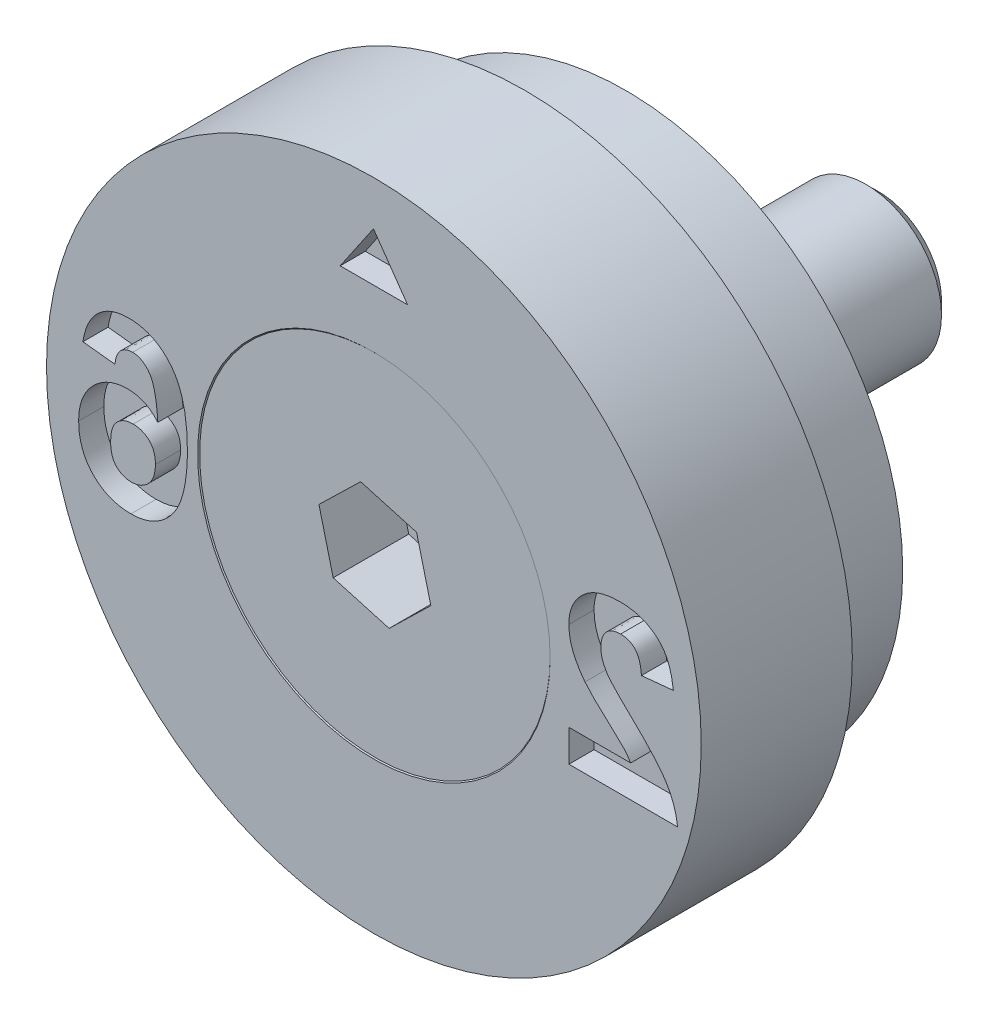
ISO-10303-21;
HEADER;
FILE_DESCRIPTION(('STEP AP214'),'2;1');
FILE_NAME('part.step','',(''),(''),'','','');
FILE_SCHEMA(('AUTOMOTIVE_DESIGN { 1 0 10303 214 1 1 1 1 }'));
ENDSEC;
DATA;
#1=APPLICATION_CONTEXT('core data for automotive mechanical design processes');
#2=APPLICATION_PROTOCOL_DEFINITION('international standard','automotive_design',2000,#1);
#3=PRODUCT_CONTEXT('',#1,'mechanical');
#4=PRODUCT('Part','Part','',(#3));
#5=PRODUCT_RELATED_PRODUCT_CATEGORY('part','',(#4));
#6=PRODUCT_DEFINITION_FORMATION('','',#4);
#7=PRODUCT_DEFINITION_CONTEXT('part definition',#1,'design');
#8=PRODUCT_DEFINITION('design','',#6,#7);
#9=PRODUCT_DEFINITION_SHAPE('','',#8);
#10=(LENGTH_UNIT() NAMED_UNIT(*) SI_UNIT(.MILLI.,.METRE.));
#11=(NAMED_UNIT(*) PLANE_ANGLE_UNIT() SI_UNIT($,.RADIAN.));
#12=(NAMED_UNIT(*) SI_UNIT($,.STERADIAN.) SOLID_ANGLE_UNIT());
#13=UNCERTAINTY_MEASURE_WITH_UNIT(LENGTH_MEASURE(1.E-05),#10,'distance_accuracy_value','');
#14=(GEOMETRIC_REPRESENTATION_CONTEXT(3) GLOBAL_UNCERTAINTY_ASSIGNED_CONTEXT((#13)) GLOBAL_UNIT_ASSIGNED_CONTEXT((#10,
#11,#12)) REPRESENTATION_CONTEXT('',''));
#15=CARTESIAN_POINT('',(0.,0.,0.));
#16=DIRECTION('',(0.,0.,1.));
#17=DIRECTION('',(1.,0.,0.));
#18=AXIS2_PLACEMENT_3D('',#15,#16,#17);
#19=CARTESIAN_POINT('',(0.,0.,-0.0200000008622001));
#20=DIRECTION('',(0.,0.,1.));
#21=DIRECTION('',(1.,0.,0.));
#22=AXIS2_PLACEMENT_3D('',#19,#20,#21);
#23=CYLINDRICAL_SURFACE('',#22,1.5);
#24=CARTESIAN_POINT('',(0.,0.,-2.0000000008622));
#25=DIRECTION('',(0.,0.,1.));
#26=DIRECTION('',(1.,0.,0.));
#27=AXIS2_PLACEMENT_3D('',#24,#25,#26);
#28=CIRCLE('',#27,1.5);
#29=CARTESIAN_POINT('',(1.5,0.,-2.0000000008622));
#30=VERTEX_POINT('',#29);
#31=EDGE_CURVE('E12',#30,#30,#28,.T.);
#32=ORIENTED_EDGE('',*,*,#31,.F.);
#33=EDGE_LOOP('',(#32));
#34=FACE_BOUND('',#33,.T.);
#35=CARTESIAN_POINT('',(0.,0.,-9.7700000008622));
#36=DIRECTION('',(0.,0.,1.));
#37=DIRECTION('',(1.,0.,0.));
#38=AXIS2_PLACEMENT_3D('',#35,#36,#37);
#39=CIRCLE('',#38,1.5);
#40=CARTESIAN_POINT('',(1.5,0.,-9.7700000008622));
#41=VERTEX_POINT('',#40);
#42=EDGE_CURVE('E150',#41,#41,#39,.T.);
#43=ORIENTED_EDGE('',*,*,#42,.T.);
#44=EDGE_LOOP('',(#43));
#45=FACE_BOUND('',#44,.T.);
#46=ADVANCED_FACE('F49',(#34,#45),#23,.T.);
#47=CARTESIAN_POINT('',(0.,0.,-2.0000000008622));
#48=DIRECTION('',(0.,0.,1.));
#49=DIRECTION('',(1.,0.,0.));
#50=AXIS2_PLACEMENT_3D('',#47,#48,#49);
#51=CONICAL_SURFACE('',#50,1.5,0.785398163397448);
#52=CARTESIAN_POINT('',(0.,0.,-0.0200000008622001));
#53=DIRECTION('',(0.,0.,1.));
#54=DIRECTION('',(1.,0.,0.));
#55=AXIS2_PLACEMENT_3D('',#52,#53,#54);
#56=CIRCLE('',#55,3.48);
#57=CARTESIAN_POINT('',(3.48,0.,-0.0200000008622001));
#58=VERTEX_POINT('',#57);
#59=EDGE_CURVE('E56',#58,#58,#56,.T.);
#60=ORIENTED_EDGE('',*,*,#59,.F.);
#61=EDGE_LOOP('',(#60));
#62=FACE_BOUND('',#61,.T.);
#63=ORIENTED_EDGE('',*,*,#31,.T.);
#64=EDGE_LOOP('',(#63));
#65=FACE_BOUND('',#64,.T.);
#66=ADVANCED_FACE('F165',(#62,#65),#51,.T.);
#67=CARTESIAN_POINT('',(0.,3.48,-0.0200000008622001));
#68=DIRECTION('',(0.,0.,-1.));
#69=DIRECTION('',(-1.,0.,0.));
#70=AXIS2_PLACEMENT_3D('',#67,#68,#69);
#71=PLANE('',#70);
#72=DIRECTION('',(0.962144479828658,-0.272539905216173,0.));
#73=VECTOR('',#72,1.);
#74=CARTESIAN_POINT('',(-0.828034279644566,-0.804793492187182,-0.0200000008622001));
#75=LINE('',#74,#73);
#76=CARTESIAN_POINT('',(-0.828034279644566,-0.804793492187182,-0.0200000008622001));
#77=VERTEX_POINT('',#76);
#78=CARTESIAN_POINT('',(0.282954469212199,-1.11949546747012,-0.0200000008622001));
#79=VERTEX_POINT('',#78);
#80=EDGE_CURVE('E137',#77,#79,#75,.T.);
#81=ORIENTED_EDGE('',*,*,#80,.F.);
#82=DIRECTION('',(0.245045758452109,-0.969511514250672,0.));
#83=VECTOR('',#82,1.);
#84=CARTESIAN_POINT('',(-1.11098874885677,0.314701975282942,-0.0200000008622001));
#85=LINE('',#84,#83);
#86=CARTESIAN_POINT('',(-1.11098874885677,0.314701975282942,-0.0200000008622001));
#87=VERTEX_POINT('',#86);
#88=EDGE_CURVE('E63',#87,#77,#85,.T.);
#89=ORIENTED_EDGE('',*,*,#88,.F.);
#90=DIRECTION('',(-0.717098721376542,-0.696971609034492,0.));
#91=VECTOR('',#90,1.);
#92=CARTESIAN_POINT('',(-0.282954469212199,1.11949546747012,-0.0200000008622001));
#93=LINE('',#92,#91);
#94=CARTESIAN_POINT('',(-0.282954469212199,1.11949546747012,-0.0200000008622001));
#95=VERTEX_POINT('',#94);
#96=EDGE_CURVE('E146',#95,#87,#93,.T.);
#97=ORIENTED_EDGE('',*,*,#96,.F.);
#98=DIRECTION('',(-0.962144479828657,0.272539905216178,0.));
#99=VECTOR('',#98,1.);
#100=CARTESIAN_POINT('',(0.828034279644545,0.804793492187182,-0.0200000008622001));
#101=LINE('',#100,#99);
#102=CARTESIAN_POINT('',(0.828034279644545,0.804793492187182,-0.0200000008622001));
#103=VERTEX_POINT('',#102);
#104=EDGE_CURVE('E144',#103,#95,#101,.T.);
#105=ORIENTED_EDGE('',*,*,#104,.F.);
#106=DIRECTION('',(-0.245045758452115,0.96951151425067,0.));
#107=VECTOR('',#106,1.);
#108=CARTESIAN_POINT('',(1.11098874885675,-0.314701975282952,-0.0200000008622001));
#109=LINE('',#108,#107);
#110=CARTESIAN_POINT('',(1.11098874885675,-0.314701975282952,-0.0200000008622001));
#111=VERTEX_POINT('',#110);
#112=EDGE_CURVE('E111',#111,#103,#109,.T.);
#113=ORIENTED_EDGE('',*,*,#112,.F.);
#114=DIRECTION('',(0.717098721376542,0.696971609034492,0.));
#115=VECTOR('',#114,1.);
#116=CARTESIAN_POINT('',(0.282954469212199,-1.11949546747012,-0.0200000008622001));
#117=LINE('',#116,#115);
#118=EDGE_CURVE('E140',#79,#111,#117,.T.);
#119=ORIENTED_EDGE('',*,*,#118,.F.);
#120=EDGE_LOOP('',(#81,#89,#97,#105,#113,#119));
#121=FACE_BOUND('',#120,.T.);
#122=ORIENTED_EDGE('',*,*,#59,.T.);
#123=EDGE_LOOP('',(#122));
#124=FACE_BOUND('',#123,.T.);
#125=ADVANCED_FACE('F163',(#121,#124),#71,.F.);
#126=CARTESIAN_POINT('',(0.,0.,-10.0200000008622));
#127=DIRECTION('',(0.,0.,1.));
#128=DIRECTION('',(1.,0.,0.));
#129=AXIS2_PLACEMENT_3D('',#126,#127,#128);
#130=PLANE('',#129);
#131=CARTESIAN_POINT('',(0.,0.,-10.0200000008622));
#132=DIRECTION('',(0.,0.,1.));
#133=DIRECTION('',(1.,0.,0.));
#134=AXIS2_PLACEMENT_3D('',#131,#132,#133);
#135=CIRCLE('',#134,1.25);
#136=CARTESIAN_POINT('',(1.25,0.,-10.0200000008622));
#137=VERTEX_POINT('',#136);
#138=EDGE_CURVE('E158',#137,#137,#135,.T.);
#139=ORIENTED_EDGE('',*,*,#138,.F.);
#140=EDGE_LOOP('',(#139));
#141=FACE_BOUND('',#140,.T.);
#142=ADVANCED_FACE('F178',(#141),#130,.F.);
#143=CARTESIAN_POINT('',(0.,0.,-10.0200000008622));
#144=DIRECTION('',(0.,0.,1.));
#145=DIRECTION('',(1.,0.,0.));
#146=AXIS2_PLACEMENT_3D('',#143,#144,#145);
#147=CONICAL_SURFACE('',#146,1.25,0.78539816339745);
#148=ORIENTED_EDGE('',*,*,#42,.F.);
#149=EDGE_LOOP('',(#148));
#150=FACE_BOUND('',#149,.T.);
#151=ORIENTED_EDGE('',*,*,#138,.T.);
#152=EDGE_LOOP('',(#151));
#153=FACE_BOUND('',#152,.T.);
#154=ADVANCED_FACE('F174',(#150,#153),#147,.T.);
#155=CARTESIAN_POINT('',(-1.11098874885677,0.314701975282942,-1.5200000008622));
#156=DIRECTION('',(-0.969511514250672,-0.245045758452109,0.));
#157=DIRECTION('',(0.245045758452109,-0.969511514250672,0.));
#158=AXIS2_PLACEMENT_3D('',#155,#156,#157);
#159=PLANE('',#158);
#160=ORIENTED_EDGE('',*,*,#88,.T.);
#161=DIRECTION('',(0.,0.,1.));
#162=VECTOR('',#161,1.);
#163=CARTESIAN_POINT('',(-0.828034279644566,-0.804793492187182,-1.5200000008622));
#164=LINE('',#163,#162);
#165=CARTESIAN_POINT('',(-0.828034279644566,-0.804793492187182,-1.5200000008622));
#166=VERTEX_POINT('',#165);
#167=EDGE_CURVE('E93',#166,#77,#164,.T.);
#168=ORIENTED_EDGE('',*,*,#167,.F.);
#169=DIRECTION('',(0.245045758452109,-0.969511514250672,0.));
#170=VECTOR('',#169,1.);
#171=CARTESIAN_POINT('',(-1.11098874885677,0.314701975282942,-1.5200000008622));
#172=LINE('',#171,#170);
#173=CARTESIAN_POINT('',(-1.11098874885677,0.314701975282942,-1.5200000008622));
#174=VERTEX_POINT('',#173);
#175=EDGE_CURVE('E148',#174,#166,#172,.T.);
#176=ORIENTED_EDGE('',*,*,#175,.F.);
#177=DIRECTION('',(0.,0.,1.));
#178=VECTOR('',#177,1.);
#179=CARTESIAN_POINT('',(-1.11098874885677,0.314701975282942,-1.5200000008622));
#180=LINE('',#179,#178);
#181=EDGE_CURVE('E71',#174,#87,#180,.T.);
#182=ORIENTED_EDGE('',*,*,#181,.T.);
#183=EDGE_LOOP('',(#160,#168,#176,#182));
#184=FACE_BOUND('',#183,.T.);
#185=ADVANCED_FACE('F177',(#184),#159,.F.);
#186=CARTESIAN_POINT('',(-0.282954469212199,1.11949546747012,-1.5200000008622));
#187=DIRECTION('',(-0.696971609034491,0.717098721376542,0.));
#188=DIRECTION('',(-0.717098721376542,-0.696971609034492,0.));
#189=AXIS2_PLACEMENT_3D('',#186,#187,#188);
#190=PLANE('',#189);
#191=ORIENTED_EDGE('',*,*,#96,.T.);
#192=ORIENTED_EDGE('',*,*,#181,.F.);
#193=DIRECTION('',(-0.717098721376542,-0.696971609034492,0.));
#194=VECTOR('',#193,1.);
#195=CARTESIAN_POINT('',(-0.282954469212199,1.11949546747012,-1.5200000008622));
#196=LINE('',#195,#194);
#197=CARTESIAN_POINT('',(-0.282954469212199,1.11949546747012,-1.5200000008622));
#198=VERTEX_POINT('',#197);
#199=EDGE_CURVE('E123',#198,#174,#196,.T.);
#200=ORIENTED_EDGE('',*,*,#199,.F.);
#201=DIRECTION('',(0.,0.,1.));
#202=VECTOR('',#201,1.);
#203=CARTESIAN_POINT('',(-0.282954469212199,1.11949546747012,-1.5200000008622));
#204=LINE('',#203,#202);
#205=EDGE_CURVE('E115',#198,#95,#204,.T.);
#206=ORIENTED_EDGE('',*,*,#205,.T.);
#207=EDGE_LOOP('',(#191,#192,#200,#206));
#208=FACE_BOUND('',#207,.T.);
#209=ADVANCED_FACE('F192',(#208),#190,.F.);
#210=CARTESIAN_POINT('',(0.828034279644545,0.804793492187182,-1.5200000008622));
#211=DIRECTION('',(0.272539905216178,0.962144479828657,0.));
#212=DIRECTION('',(-0.962144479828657,0.272539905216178,0.));
#213=AXIS2_PLACEMENT_3D('',#210,#211,#212);
#214=PLANE('',#213);
#215=ORIENTED_EDGE('',*,*,#104,.T.);
#216=ORIENTED_EDGE('',*,*,#205,.F.);
#217=DIRECTION('',(-0.962144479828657,0.272539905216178,0.));
#218=VECTOR('',#217,1.);
#219=CARTESIAN_POINT('',(0.828034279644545,0.804793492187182,-1.5200000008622));
#220=LINE('',#219,#218);
#221=CARTESIAN_POINT('',(0.828034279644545,0.804793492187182,-1.5200000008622));
#222=VERTEX_POINT('',#221);
#223=EDGE_CURVE('E119',#222,#198,#220,.T.);
#224=ORIENTED_EDGE('',*,*,#223,.F.);
#225=DIRECTION('',(0.,0.,1.));
#226=VECTOR('',#225,1.);
#227=CARTESIAN_POINT('',(0.828034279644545,0.804793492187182,-1.5200000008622));
#228=LINE('',#227,#226);
#229=EDGE_CURVE('E104',#222,#103,#228,.T.);
#230=ORIENTED_EDGE('',*,*,#229,.T.);
#231=EDGE_LOOP('',(#215,#216,#224,#230));
#232=FACE_BOUND('',#231,.T.);
#233=ADVANCED_FACE('F120',(#232),#214,.F.);
#234=CARTESIAN_POINT('',(1.11098874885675,-0.314701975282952,-1.5200000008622));
#235=DIRECTION('',(0.96951151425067,0.245045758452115,0.));
#236=DIRECTION('',(-0.245045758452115,0.96951151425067,0.));
#237=AXIS2_PLACEMENT_3D('',#234,#235,#236);
#238=PLANE('',#237);
#239=ORIENTED_EDGE('',*,*,#112,.T.);
#240=ORIENTED_EDGE('',*,*,#229,.F.);
#241=DIRECTION('',(-0.245045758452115,0.96951151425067,0.));
#242=VECTOR('',#241,1.);
#243=CARTESIAN_POINT('',(1.11098874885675,-0.314701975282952,-1.5200000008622));
#244=LINE('',#243,#242);
#245=CARTESIAN_POINT('',(1.11098874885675,-0.314701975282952,-1.5200000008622));
#246=VERTEX_POINT('',#245);
#247=EDGE_CURVE('E108',#246,#222,#244,.T.);
#248=ORIENTED_EDGE('',*,*,#247,.F.);
#249=DIRECTION('',(0.,0.,1.));
#250=VECTOR('',#249,1.);
#251=CARTESIAN_POINT('',(1.11098874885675,-0.314701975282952,-1.5200000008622));
#252=LINE('',#251,#250);
#253=EDGE_CURVE('E116',#246,#111,#252,.T.);
#254=ORIENTED_EDGE('',*,*,#253,.T.);
#255=EDGE_LOOP('',(#239,#240,#248,#254));
#256=FACE_BOUND('',#255,.T.);
#257=ADVANCED_FACE('F106',(#256),#238,.F.);
#258=CARTESIAN_POINT('',(0.282954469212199,-1.11949546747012,-1.5200000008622));
#259=DIRECTION('',(0.696971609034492,-0.717098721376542,0.));
#260=DIRECTION('',(0.717098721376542,0.696971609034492,0.));
#261=AXIS2_PLACEMENT_3D('',#258,#259,#260);
#262=PLANE('',#261);
#263=ORIENTED_EDGE('',*,*,#118,.T.);
#264=ORIENTED_EDGE('',*,*,#253,.F.);
#265=DIRECTION('',(0.717098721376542,0.696971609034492,0.));
#266=VECTOR('',#265,1.);
#267=CARTESIAN_POINT('',(0.282954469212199,-1.11949546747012,-1.5200000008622));
#268=LINE('',#267,#266);
#269=CARTESIAN_POINT('',(0.282954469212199,-1.11949546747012,-1.5200000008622));
#270=VERTEX_POINT('',#269);
#271=EDGE_CURVE('E129',#270,#246,#268,.T.);
#272=ORIENTED_EDGE('',*,*,#271,.F.);
#273=DIRECTION('',(0.,0.,1.));
#274=VECTOR('',#273,1.);
#275=CARTESIAN_POINT('',(0.282954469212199,-1.11949546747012,-1.5200000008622));
#276=LINE('',#275,#274);
#277=EDGE_CURVE('E153',#270,#79,#276,.T.);
#278=ORIENTED_EDGE('',*,*,#277,.T.);
#279=EDGE_LOOP('',(#263,#264,#272,#278));
#280=FACE_BOUND('',#279,.T.);
#281=ADVANCED_FACE('F196',(#280),#262,.F.);
#282=CARTESIAN_POINT('',(-0.828034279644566,-0.804793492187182,-1.5200000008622));
#283=DIRECTION('',(-0.272539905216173,-0.962144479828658,0.));
#284=DIRECTION('',(0.962144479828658,-0.272539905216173,0.));
#285=AXIS2_PLACEMENT_3D('',#282,#283,#284);
#286=PLANE('',#285);
#287=ORIENTED_EDGE('',*,*,#80,.T.);
#288=ORIENTED_EDGE('',*,*,#277,.F.);
#289=DIRECTION('',(0.962144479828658,-0.272539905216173,0.));
#290=VECTOR('',#289,1.);
#291=CARTESIAN_POINT('',(-0.828034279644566,-0.804793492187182,-1.5200000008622));
#292=LINE('',#291,#290);
#293=EDGE_CURVE('E131',#166,#270,#292,.T.);
#294=ORIENTED_EDGE('',*,*,#293,.F.);
#295=ORIENTED_EDGE('',*,*,#167,.T.);
#296=EDGE_LOOP('',(#287,#288,#294,#295));
#297=FACE_BOUND('',#296,.T.);
#298=ADVANCED_FACE('F193',(#297),#286,.F.);
#299=CARTESIAN_POINT('',(0.,0.,-1.5200000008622));
#300=DIRECTION('',(0.,0.,1.));
#301=DIRECTION('',(1.,0.,0.));
#302=AXIS2_PLACEMENT_3D('',#299,#300,#301);
#303=PLANE('',#302);
#304=ORIENTED_EDGE('',*,*,#175,.T.);
#305=ORIENTED_EDGE('',*,*,#293,.T.);
#306=ORIENTED_EDGE('',*,*,#271,.T.);
#307=ORIENTED_EDGE('',*,*,#247,.T.);
#308=ORIENTED_EDGE('',*,*,#223,.T.);
#309=ORIENTED_EDGE('',*,*,#199,.T.);
#310=EDGE_LOOP('',(#304,#305,#306,#307,#308,#309));
#311=FACE_BOUND('',#310,.T.);
#312=ADVANCED_FACE('F126',(#311),#303,.T.);
#313=CLOSED_SHELL('',(#46,#66,#125,#142,#154,#185,#209,#233,#257,#281,#298,#312));
#314=MANIFOLD_SOLID_BREP('B2',#313);
#315=CARTESIAN_POINT('',(0.,6.5,0.));
#316=DIRECTION('',(0.,0.,-1.));
#317=DIRECTION('',(-1.,0.,0.));
#318=AXIS2_PLACEMENT_3D('',#315,#316,#317);
#319=PLANE('',#318);
#320=DIRECTION('',(0.,-1.,0.));
#321=VECTOR('',#320,1.);
#322=CARTESIAN_POINT('',(3.87166666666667,-1.016,0.));
#323=LINE('',#322,#321);
#324=CARTESIAN_POINT('',(3.87166666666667,-1.016,0.));
#325=VERTEX_POINT('',#324);
#326=CARTESIAN_POINT('',(3.87166666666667,-1.651,0.));
#327=VERTEX_POINT('',#326);
#328=EDGE_CURVE('E694',#325,#327,#323,.T.);
#329=ORIENTED_EDGE('',*,*,#328,.F.);
#330=DIRECTION('',(-1.,0.,0.));
#331=VECTOR('',#330,1.);
#332=CARTESIAN_POINT('',(5.098671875,-1.016,0.));
#333=LINE('',#332,#331);
#334=CARTESIAN_POINT('',(5.098671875,-1.016,0.));
#335=VERTEX_POINT('',#334);
#336=EDGE_CURVE('E323',#335,#325,#333,.T.);
#337=ORIENTED_EDGE('',*,*,#336,.F.);
#338=CARTESIAN_POINT('',(4.1918125,-0.07540625,0.));
#339=CARTESIAN_POINT('',(4.20185584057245,-0.0880558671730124,0.));
#340=CARTESIAN_POINT('',(4.22336634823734,-0.115148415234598,0.));
#341=CARTESIAN_POINT('',(4.25996137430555,-0.156690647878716,0.));
#342=CARTESIAN_POINT('',(4.30237186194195,-0.202067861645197,0.));
#343=CARTESIAN_POINT('',(4.34999878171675,-0.252129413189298,0.));
#344=CARTESIAN_POINT('',(4.40441534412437,-0.30510248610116,0.));
#345=CARTESIAN_POINT('',(4.46366363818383,-0.363202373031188,0.));
#346=CARTESIAN_POINT('',(4.53035076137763,-0.423457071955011,0.));
#347=CARTESIAN_POINT('',(4.59942246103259,-0.487369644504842,0.));
#348=CARTESIAN_POINT('',(4.6687943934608,-0.549574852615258,0.));
#349=CARTESIAN_POINT('',(4.73255720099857,-0.608656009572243,0.));
#350=CARTESIAN_POINT('',(4.7904750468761,-0.66093014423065,0.));
#351=CARTESIAN_POINT('',(4.83985058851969,-0.709283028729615,0.));
#352=CARTESIAN_POINT('',(4.88358808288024,-0.750414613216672,0.));
#353=CARTESIAN_POINT('',(4.92011108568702,-0.786434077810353,0.));
#354=CARTESIAN_POINT('',(4.95010302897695,-0.816469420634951,0.));
#355=CARTESIAN_POINT('',(4.9914299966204,-0.86328689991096,0.));
#356=CARTESIAN_POINT('',(5.04401387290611,-0.926607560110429,0.));
#357=CARTESIAN_POINT('',(5.08100877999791,-0.987112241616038,0.));
#358=CARTESIAN_POINT('',(5.098671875,-1.016,0.));
#359=B_SPLINE_CURVE_WITH_KNOTS('',3,(#338,#339,#340,#341,#342,#343,#344,#345,#346,#347,#348,
#349,#350,#351,#352,#353,#354,#355,#356,#357,#358),.UNSPECIFIED.,.F.,.F.,(4,1,1,1,1,1,1,1,1,1,1,
1,1,1,1,1,1,1,4),(0.,0.0369753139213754,0.0791925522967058,0.126700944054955,0.17918407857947,
0.23736864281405,0.300558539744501,0.369153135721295,0.443112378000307,0.516018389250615,
0.582473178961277,0.642136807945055,0.694619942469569,0.740679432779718,0.779589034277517,
0.812073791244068,0.837814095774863,0.922564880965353,1.),.UNSPECIFIED.);
#360=CARTESIAN_POINT('',(4.1918125,-0.07540625,0.));
#361=VERTEX_POINT('',#360);
#362=EDGE_CURVE('E520',#361,#335,#359,.T.);
#363=ORIENTED_EDGE('',*,*,#362,.F.);
#364=CARTESIAN_POINT('',(3.87166666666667,0.752739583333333,0.));
#365=CARTESIAN_POINT('',(3.8724745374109,0.716746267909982,0.));
#366=CARTESIAN_POINT('',(3.87407722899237,0.64534105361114,0.));
#367=CARTESIAN_POINT('',(3.88942181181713,0.539782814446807,0.));
#368=CARTESIAN_POINT('',(3.91286534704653,0.436658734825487,0.));
#369=CARTESIAN_POINT('',(3.94751304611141,0.335716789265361,0.));
#370=CARTESIAN_POINT('',(3.99143169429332,0.234535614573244,0.));
#371=CARTESIAN_POINT('',(4.04804388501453,0.13288810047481,0.));
#372=CARTESIAN_POINT('',(4.11377491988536,0.027708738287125,0.));
#373=CARTESIAN_POINT('',(4.16523972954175,-0.0402943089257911,0.));
#374=CARTESIAN_POINT('',(4.1918125,-0.07540625,0.));
#375=B_SPLINE_CURVE_WITH_KNOTS('',3,(#364,#365,#366,#367,#368,#369,#370,#371,#372,#373,#374),
.UNSPECIFIED.,.F.,.F.,(4,1,1,1,1,1,1,1,4),(0.,0.119176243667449,0.236427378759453,
0.352663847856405,0.469086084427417,0.589462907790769,0.717601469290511,0.854189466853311,1.),.UNSPECIFIED.);
#376=CARTESIAN_POINT('',(3.87166666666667,0.752739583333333,0.));
#377=VERTEX_POINT('',#376);
#378=EDGE_CURVE('E523',#377,#361,#375,.T.);
#379=ORIENTED_EDGE('',*,*,#378,.F.);
#380=CARTESIAN_POINT('',(4.88502083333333,1.651,0.));
#381=CARTESIAN_POINT('',(4.84662784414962,1.65026210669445,0.));
#382=CARTESIAN_POINT('',(4.77185267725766,1.64882496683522,0.));
#383=CARTESIAN_POINT('',(4.66269420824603,1.63695705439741,0.));
#384=CARTESIAN_POINT('',(4.56014766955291,1.61626362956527,0.));
#385=CARTESIAN_POINT('',(4.4633165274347,1.58885225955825,0.));
#386=CARTESIAN_POINT('',(4.3731951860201,1.55225607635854,0.));
#387=CARTESIAN_POINT('',(4.28903266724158,1.50801281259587,0.));
#388=CARTESIAN_POINT('',(4.2121535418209,1.45444334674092,0.));
#389=CARTESIAN_POINT('',(4.14141182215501,1.39446904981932,0.));
#390=CARTESIAN_POINT('',(4.07817438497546,1.32851676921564,0.));
#391=CARTESIAN_POINT('',(4.02278411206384,1.25816751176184,0.));
#392=CARTESIAN_POINT('',(3.97637832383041,1.18347028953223,0.));
#393=CARTESIAN_POINT('',(3.9374367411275,1.10533557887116,0.));
#394=CARTESIAN_POINT('',(3.90852287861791,1.02250607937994,0.));
#395=CARTESIAN_POINT('',(3.88745498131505,0.936127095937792,0.));
#396=CARTESIAN_POINT('',(3.87348611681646,0.845795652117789,0.));
#397=CARTESIAN_POINT('',(3.87227985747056,0.784101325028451,0.));
#398=CARTESIAN_POINT('',(3.87166666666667,0.752739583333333,0.));
#399=B_SPLINE_CURVE_WITH_KNOTS('',3,(#380,#381,#382,#383,#384,#385,#386,#387,#388,#389,#390,
#391,#392,#393,#394,#395,#396,#397,#398),.UNSPECIFIED.,.F.,.F.,(4,1,1,1,1,1,1,1,1,1,1,1,1,1,1,1,
4),(0.,0.0756723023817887,0.147381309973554,0.216084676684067,0.28169803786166,
0.345459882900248,0.407485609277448,0.46873129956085,0.529782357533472,0.590032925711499,
0.648548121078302,0.70595351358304,0.763101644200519,0.820289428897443,0.878479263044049,
0.938226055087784,1.),.UNSPECIFIED.);
#400=CARTESIAN_POINT('',(4.88502083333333,1.651,0.));
#401=VERTEX_POINT('',#400);
#402=EDGE_CURVE('E1332',#401,#377,#399,.T.);
#403=ORIENTED_EDGE('',*,*,#402,.F.);
#404=CARTESIAN_POINT('',(5.946,0.65484375,0.));
#405=CARTESIAN_POINT('',(5.94089469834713,0.697714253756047,0.));
#406=CARTESIAN_POINT('',(5.93099633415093,0.780833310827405,0.));
#407=CARTESIAN_POINT('',(5.90629480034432,0.900220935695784,0.));
#408=CARTESIAN_POINT('',(5.87501122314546,1.01036140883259,0.));
#409=CARTESIAN_POINT('',(5.835654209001,1.11105032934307,0.));
#410=CARTESIAN_POINT('',(5.78985043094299,1.20292798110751,0.));
#411=CARTESIAN_POINT('',(5.73526351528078,1.28461568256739,0.));
#412=CARTESIAN_POINT('',(5.67380078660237,1.35701830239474,0.));
#413=CARTESIAN_POINT('',(5.60540912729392,1.42009730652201,0.));
#414=CARTESIAN_POINT('',(5.53052332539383,1.47405336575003,0.));
#415=CARTESIAN_POINT('',(5.45194411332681,1.52221742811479,0.));
#416=CARTESIAN_POINT('',(5.36813583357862,1.56172727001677,0.));
#417=CARTESIAN_POINT('',(5.28002121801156,1.59428931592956,0.));
#418=CARTESIAN_POINT('',(5.18764008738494,1.62031264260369,0.));
#419=CARTESIAN_POINT('',(5.09056516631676,1.63751891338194,0.));
#420=CARTESIAN_POINT('',(4.98939556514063,1.64962187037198,0.));
#421=CARTESIAN_POINT('',(4.92033677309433,1.65053369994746,0.));
#422=CARTESIAN_POINT('',(4.88502083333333,1.651,0.));
#423=B_SPLINE_CURVE_WITH_KNOTS('',3,(#404,#405,#406,#407,#408,#409,#410,#411,#412,#413,#414,
#415,#416,#417,#418,#419,#420,#421,#422),.UNSPECIFIED.,.F.,.F.,(4,1,1,1,1,1,1,1,1,1,1,1,1,1,1,1,
4),(0.,0.0794357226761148,0.154013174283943,0.224141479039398,0.289934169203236,
0.352732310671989,0.412725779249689,0.470302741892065,0.527168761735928,0.583502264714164,
0.639948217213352,0.696584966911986,0.753726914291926,0.812707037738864,0.872963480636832,
0.93503486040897,1.),.UNSPECIFIED.);
#424=CARTESIAN_POINT('',(5.946,0.65484375,0.));
#425=VERTEX_POINT('',#424);
#426=EDGE_CURVE('E1327',#425,#401,#423,.T.);
#427=ORIENTED_EDGE('',*,*,#426,.F.);
#428=DIRECTION('',(0.995240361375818,0.0974506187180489,0.));
#429=VECTOR('',#428,1.);
#430=CARTESIAN_POINT('',(5.311,0.592666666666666,0.));
#431=LINE('',#430,#429);
#432=CARTESIAN_POINT('',(5.311,0.592666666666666,0.));
#433=VERTEX_POINT('',#432);
#434=EDGE_CURVE('E1321',#433,#425,#431,.T.);
#435=ORIENTED_EDGE('',*,*,#434,.F.);
#436=CARTESIAN_POINT('',(4.89825,1.10066666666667,0.));
#437=CARTESIAN_POINT('',(4.92705082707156,1.09936181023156,0.));
#438=CARTESIAN_POINT('',(4.98268780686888,1.09684110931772,0.));
#439=CARTESIAN_POINT('',(5.06176002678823,1.07482061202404,0.));
#440=CARTESIAN_POINT('',(5.13093362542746,1.03670081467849,0.));
#441=CARTESIAN_POINT('',(5.180230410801,0.993259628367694,0.));
#442=CARTESIAN_POINT('',(5.213532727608,0.951016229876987,0.));
#443=CARTESIAN_POINT('',(5.23622376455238,0.914203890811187,0.));
#444=CARTESIAN_POINT('',(5.25578166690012,0.872373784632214,0.));
#445=CARTESIAN_POINT('',(5.27311160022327,0.825996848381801,0.));
#446=CARTESIAN_POINT('',(5.2868002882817,0.774541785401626,0.));
#447=CARTESIAN_POINT('',(5.29782430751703,0.718400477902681,0.));
#448=CARTESIAN_POINT('',(5.30670807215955,0.657270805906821,0.));
#449=CARTESIAN_POINT('',(5.30953326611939,0.614744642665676,0.));
#450=CARTESIAN_POINT('',(5.311,0.592666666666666,0.));
#451=B_SPLINE_CURVE_WITH_KNOTS('',3,(#436,#437,#438,#439,#440,#441,#442,#443,#444,#445,#446,
#447,#448,#449,#450),.UNSPECIFIED.,.F.,.F.,(4,1,1,1,1,1,1,1,1,1,1,1,4),(0.,0.116899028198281,
0.225823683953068,0.330086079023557,0.435451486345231,0.490306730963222,0.548244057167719,
0.610766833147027,0.677675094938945,0.749188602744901,0.826858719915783,0.910111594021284,1.),.UNSPECIFIED.);
#452=CARTESIAN_POINT('',(4.89825,1.10066666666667,0.));
#453=VERTEX_POINT('',#452);
#454=EDGE_CURVE('E1301',#453,#433,#451,.T.);
#455=ORIENTED_EDGE('',*,*,#454,.F.);
#456=CARTESIAN_POINT('',(4.50666666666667,0.667411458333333,0.));
#457=CARTESIAN_POINT('',(4.50785593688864,0.700356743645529,0.));
#458=CARTESIAN_POINT('',(4.51010594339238,0.762686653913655,0.));
#459=CARTESIAN_POINT('',(4.52897263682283,0.850645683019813,0.));
#460=CARTESIAN_POINT('',(4.56242965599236,0.926258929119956,0.));
#461=CARTESIAN_POINT('',(4.60849381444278,0.989758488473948,0.));
#462=CARTESIAN_POINT('',(4.66674203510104,1.03951015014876,0.));
#463=CARTESIAN_POINT('',(4.73483589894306,1.07627179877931,0.));
#464=CARTESIAN_POINT('',(4.81377219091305,1.09659619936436,0.));
#465=CARTESIAN_POINT('',(4.86925327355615,1.09926949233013,0.));
#466=CARTESIAN_POINT('',(4.89825,1.10066666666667,0.));
#467=B_SPLINE_CURVE_WITH_KNOTS('',3,(#456,#457,#458,#459,#460,#461,#462,#463,#464,#465,#466),
.UNSPECIFIED.,.F.,.F.,(4,1,1,1,1,1,1,1,4),(0.,0.149140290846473,0.282161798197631,
0.40465570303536,0.521109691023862,0.634416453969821,0.748796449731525,0.868710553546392,1.),.UNSPECIFIED.);
#468=CARTESIAN_POINT('',(4.50666666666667,0.667411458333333,0.));
#469=VERTEX_POINT('',#468);
#470=EDGE_CURVE('E1299',#469,#453,#467,.T.);
#471=ORIENTED_EDGE('',*,*,#470,.F.);
#472=CARTESIAN_POINT('',(4.63234375,0.28575,0.));
#473=CARTESIAN_POINT('',(4.61322533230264,0.317507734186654,0.));
#474=CARTESIAN_POINT('',(4.57634811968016,0.378764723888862,0.));
#475=CARTESIAN_POINT('',(4.53590919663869,0.475092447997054,0.));
#476=CARTESIAN_POINT('',(4.51163624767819,0.571400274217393,0.));
#477=CARTESIAN_POINT('',(4.50830534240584,0.635752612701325,0.));
#478=CARTESIAN_POINT('',(4.50666666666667,0.667411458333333,0.));
#479=B_SPLINE_CURVE_WITH_KNOTS('',3,(#472,#473,#474,#475,#476,#477,#478),.UNSPECIFIED.,.F.,.F.,
(4,1,1,1,4),(0.,0.272795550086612,0.526191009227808,0.766904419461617,1.),.UNSPECIFIED.);
#480=CARTESIAN_POINT('',(4.63234375,0.28575,0.));
#481=VERTEX_POINT('',#480);
#482=EDGE_CURVE('E1292',#481,#469,#479,.T.);
#483=ORIENTED_EDGE('',*,*,#482,.F.);
#484=CARTESIAN_POINT('',(5.13769791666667,-0.247385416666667,0.));
#485=CARTESIAN_POINT('',(5.10505094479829,-0.215872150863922,0.));
#486=CARTESIAN_POINT('',(5.04290072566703,-0.155880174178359,0.));
#487=CARTESIAN_POINT('',(4.95439869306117,-0.0699740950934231,0.));
#488=CARTESIAN_POINT('',(4.87659628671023,0.00899800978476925,0.));
#489=CARTESIAN_POINT('',(4.8078667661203,0.0789896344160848,0.));
#490=CARTESIAN_POINT('',(4.749797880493,0.141782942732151,0.));
#491=CARTESIAN_POINT('',(4.70162578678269,0.196391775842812,0.));
#492=CARTESIAN_POINT('',(4.66274039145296,0.243038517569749,0.));
#493=CARTESIAN_POINT('',(4.64168002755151,0.272631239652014,0.));
#494=CARTESIAN_POINT('',(4.63234375,0.28575,0.));
#495=B_SPLINE_CURVE_WITH_KNOTS('',3,(#484,#485,#486,#487,#488,#489,#490,#491,#492,#493,#494),
.UNSPECIFIED.,.F.,.F.,(4,1,1,1,1,1,1,1,4),(0.,0.185090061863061,0.352356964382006,
0.503079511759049,0.637279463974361,0.752473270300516,0.851885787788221,0.934339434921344,1.),.UNSPECIFIED.);
#496=CARTESIAN_POINT('',(5.13769791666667,-0.247385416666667,0.));
#497=VERTEX_POINT('',#496);
#498=EDGE_CURVE('E1284',#497,#481,#495,.T.);
#499=ORIENTED_EDGE('',*,*,#498,.F.);
#500=CARTESIAN_POINT('',(6.03066666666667,-1.651,0.));
#501=CARTESIAN_POINT('',(6.0233567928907,-1.59673003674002,0.));
#502=CARTESIAN_POINT('',(6.0087411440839,-1.48822054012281,0.));
#503=CARTESIAN_POINT('',(5.96355478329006,-1.32971547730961,0.));
#504=CARTESIAN_POINT('',(5.90324646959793,-1.17504161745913,0.));
#505=CARTESIAN_POINT('',(5.83779325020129,-1.04917463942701,0.));
#506=CARTESIAN_POINT('',(5.77269277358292,-0.947856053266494,0.));
#507=CARTESIAN_POINT('',(5.71362710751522,-0.864834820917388,0.));
#508=CARTESIAN_POINT('',(5.64316393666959,-0.776503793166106,0.));
#509=CARTESIAN_POINT('',(5.56232575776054,-0.682149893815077,0.));
#510=CARTESIAN_POINT('',(5.47155931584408,-0.58147817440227,0.));
#511=CARTESIAN_POINT('',(5.37018743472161,-0.474862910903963,0.));
#512=CARTESIAN_POINT('',(5.25772655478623,-0.362814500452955,0.));
#513=CARTESIAN_POINT('',(5.17860832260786,-0.286728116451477,0.));
#514=CARTESIAN_POINT('',(5.13769791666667,-0.247385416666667,0.));
#515=B_SPLINE_CURVE_WITH_KNOTS('',3,(#500,#501,#502,#503,#504,#505,#506,#507,#508,#509,#510,
#511,#512,#513,#514),.UNSPECIFIED.,.F.,.F.,(4,1,1,1,1,1,1,1,1,1,1,1,4),(0.,0.0963574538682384,
0.192660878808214,0.289454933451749,0.388479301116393,0.441921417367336,0.501521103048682,
0.567882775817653,0.640891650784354,0.72037065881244,0.806636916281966,0.900015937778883,1.),.UNSPECIFIED.);
#516=CARTESIAN_POINT('',(6.03066666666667,-1.651,0.));
#517=VERTEX_POINT('',#516);
#518=EDGE_CURVE('E1293',#517,#497,#515,.T.);
#519=ORIENTED_EDGE('',*,*,#518,.F.);
#520=DIRECTION('',(1.,0.,0.));
#521=VECTOR('',#520,1.);
#522=CARTESIAN_POINT('',(3.87166666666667,-1.651,0.));
#523=LINE('',#522,#521);
#524=EDGE_CURVE('E1400',#327,#517,#523,.T.);
#525=ORIENTED_EDGE('',*,*,#524,.F.);
#526=EDGE_LOOP('',(#329,#337,#363,#379,#403,#427,#435,#455,#471,#483,#499,#519,#525));
#527=FACE_BOUND('',#526,.T.);
#528=DIRECTION('',(0.994071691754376,-0.108726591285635,0.));
#529=VECTOR('',#528,1.);
#530=CARTESIAN_POINT('',(-5.77694666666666,0.789119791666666,0.));
#531=LINE('',#530,#529);
#532=CARTESIAN_POINT('',(-5.77694666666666,0.789119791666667,0.));
#533=VERTEX_POINT('',#532);
#534=CARTESIAN_POINT('',(-5.14194666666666,0.719666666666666,0.));
#535=VERTEX_POINT('',#534);
#536=EDGE_CURVE('E699',#533,#535,#531,.T.);
#537=ORIENTED_EDGE('',*,*,#536,.F.);
#538=CARTESIAN_POINT('',(-4.87074875,1.651,0.));
#539=CARTESIAN_POINT('',(-4.90055018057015,1.65046385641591,0.));
#540=CARTESIAN_POINT('',(-4.95880816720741,1.64941576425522,0.));
#541=CARTESIAN_POINT('',(-5.04419363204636,1.63828589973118,0.));
#542=CARTESIAN_POINT('',(-5.12565057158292,1.62126653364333,0.));
#543=CARTESIAN_POINT('',(-5.20339247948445,1.59770778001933,0.));
#544=CARTESIAN_POINT('',(-5.27687199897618,1.56615805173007,0.));
#545=CARTESIAN_POINT('',(-5.34638091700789,1.52772317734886,0.));
#546=CARTESIAN_POINT('',(-5.41215290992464,1.48250725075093,0.));
#547=CARTESIAN_POINT('',(-5.47384576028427,1.43080138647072,0.));
#548=CARTESIAN_POINT('',(-5.53096294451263,1.37244909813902,0.));
#549=CARTESIAN_POINT('',(-5.58253843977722,1.30731836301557,0.));
#550=CARTESIAN_POINT('',(-5.62891380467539,1.23619522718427,0.));
#551=CARTESIAN_POINT('',(-5.67029200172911,1.15913871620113,0.));
#552=CARTESIAN_POINT('',(-5.70499935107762,1.07541082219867,0.));
#553=CARTESIAN_POINT('',(-5.73483604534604,0.985669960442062,0.));
#554=CARTESIAN_POINT('',(-5.75937465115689,0.88972333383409,0.));
#555=CARTESIAN_POINT('',(-5.7710000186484,0.823165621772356,0.));
#556=CARTESIAN_POINT('',(-5.77694666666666,0.789119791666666,0.));
#557=B_SPLINE_CURVE_WITH_KNOTS('',3,(#538,#539,#540,#541,#542,#543,#544,#545,#546,#547,#548,
#549,#550,#551,#552,#553,#554,#555,#556),.UNSPECIFIED.,.F.,.F.,(4,1,1,1,1,1,1,1,1,1,1,1,1,1,1,1,
4),(0.,0.0647517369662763,0.126581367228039,0.186839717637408,0.245514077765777,
0.302849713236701,0.360345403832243,0.417912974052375,0.476091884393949,0.535068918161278,
0.595103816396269,0.656390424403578,0.719434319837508,0.784953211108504,0.853160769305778,
0.924888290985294,1.),.UNSPECIFIED.);
#558=CARTESIAN_POINT('',(-4.87074875,1.651,0.));
#559=VERTEX_POINT('',#558);
#560=EDGE_CURVE('E331',#559,#533,#557,.T.);
#561=ORIENTED_EDGE('',*,*,#560,.F.);
#562=CARTESIAN_POINT('',(-3.70261333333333,-0.0443177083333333,0.));
#563=CARTESIAN_POINT('',(-3.70360059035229,0.0280311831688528,0.));
#564=CARTESIAN_POINT('',(-3.70550820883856,0.167826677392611,0.));
#565=CARTESIAN_POINT('',(-3.72085863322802,0.36967222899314,0.));
#566=CARTESIAN_POINT('',(-3.74524142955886,0.556068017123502,0.));
#567=CARTESIAN_POINT('',(-3.78076108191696,0.72659370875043,0.));
#568=CARTESIAN_POINT('',(-3.82619346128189,0.881603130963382,0.));
#569=CARTESIAN_POINT('',(-3.88127288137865,1.02140779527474,0.));
#570=CARTESIAN_POINT('',(-3.94738311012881,1.14550157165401,0.));
#571=CARTESIAN_POINT('',(-4.02424659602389,1.25348089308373,0.));
#572=CARTESIAN_POINT('',(-4.10881858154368,1.3473433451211,0.));
#573=CARTESIAN_POINT('',(-4.19969155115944,1.42836257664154,0.));
#574=CARTESIAN_POINT('',(-4.2965185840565,1.49732201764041,0.));
#575=CARTESIAN_POINT('',(-4.3992973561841,1.55404753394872,0.));
#576=CARTESIAN_POINT('',(-4.5088715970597,1.59705082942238,0.));
#577=CARTESIAN_POINT('',(-4.62420196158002,1.62810458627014,0.));
#578=CARTESIAN_POINT('',(-4.74548216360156,1.64806234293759,0.));
#579=CARTESIAN_POINT('',(-4.8285571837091,1.65001055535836,0.));
#580=CARTESIAN_POINT('',(-4.87074875,1.651,0.));
#581=B_SPLINE_CURVE_WITH_KNOTS('',3,(#562,#563,#564,#565,#566,#567,#568,#569,#570,#571,#572,
#573,#574,#575,#576,#577,#578,#579,#580),.UNSPECIFIED.,.F.,.F.,(4,1,1,1,1,1,1,1,1,1,1,1,1,1,1,1,
4),(0.,0.0932311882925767,0.180145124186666,0.260720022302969,0.335343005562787,
0.40439372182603,0.46866345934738,0.528671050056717,0.585123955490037,0.639046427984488,
0.691174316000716,0.741714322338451,0.79194664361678,0.84207517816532,0.893016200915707,
0.945665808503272,1.),.UNSPECIFIED.);
#582=CARTESIAN_POINT('',(-3.70261333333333,-0.0443177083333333,0.));
#583=VERTEX_POINT('',#582);
#584=EDGE_CURVE('E627',#583,#559,#581,.T.);
#585=ORIENTED_EDGE('',*,*,#584,.F.);
#586=CARTESIAN_POINT('',(-4.82312375,-1.69333333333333,0.));
#587=CARTESIAN_POINT('',(-4.78315094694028,-1.69221500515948,0.));
#588=CARTESIAN_POINT('',(-4.70455730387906,-1.69001617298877,0.));
#589=CARTESIAN_POINT('',(-4.5895049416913,-1.67192089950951,0.));
#590=CARTESIAN_POINT('',(-4.48012295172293,-1.6413065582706,0.));
#591=CARTESIAN_POINT('',(-4.37642492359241,-1.59855232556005,0.));
#592=CARTESIAN_POINT('',(-4.27754895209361,-1.54477412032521,0.));
#593=CARTESIAN_POINT('',(-4.18441317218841,-1.47797178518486,0.));
#594=CARTESIAN_POINT('',(-4.09726439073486,-1.3987823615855,0.));
#595=CARTESIAN_POINT('',(-4.01494992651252,-1.30827825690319,0.));
#596=CARTESIAN_POINT('',(-3.94004596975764,-1.20373886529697,0.));
#597=CARTESIAN_POINT('',(-3.87625712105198,-1.08291331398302,0.));
#598=CARTESIAN_POINT('',(-3.82215778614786,-0.947124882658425,0.));
#599=CARTESIAN_POINT('',(-3.77811300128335,-0.796025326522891,0.));
#600=CARTESIAN_POINT('',(-3.74411360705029,-0.629626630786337,0.));
#601=CARTESIAN_POINT('',(-3.72038960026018,-0.447914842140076,0.));
#602=CARTESIAN_POINT('',(-3.70463190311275,-0.251190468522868,0.));
#603=CARTESIAN_POINT('',(-3.70330210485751,-0.114906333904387,0.));
#604=CARTESIAN_POINT('',(-3.70261333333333,-0.0443177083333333,0.));
#605=B_SPLINE_CURVE_WITH_KNOTS('',3,(#586,#587,#588,#589,#590,#591,#592,#593,#594,#595,#596,
#597,#598,#599,#600,#601,#602,#603,#604),.UNSPECIFIED.,.F.,.F.,(4,1,1,1,1,1,1,1,1,1,1,1,1,1,1,1,
4),(0.,0.0532594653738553,0.104717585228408,0.154775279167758,0.204330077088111,
0.253913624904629,0.30447604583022,0.356706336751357,0.410596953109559,0.467274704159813,
0.527625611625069,0.59224090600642,0.661798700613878,0.737130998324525,0.818387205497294,
0.905933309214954,1.),.UNSPECIFIED.);
#606=CARTESIAN_POINT('',(-4.82312375,-1.69333333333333,0.));
#607=VERTEX_POINT('',#606);
#608=EDGE_CURVE('E785',#607,#583,#605,.T.);
#609=ORIENTED_EDGE('',*,*,#608,.F.);
#610=CARTESIAN_POINT('',(-5.86161333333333,-0.616479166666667,0.));
#611=CARTESIAN_POINT('',(-5.86069676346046,-0.656200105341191,0.));
#612=CARTESIAN_POINT('',(-5.85890923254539,-0.733665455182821,0.));
#613=CARTESIAN_POINT('',(-5.84575175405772,-0.847115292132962,0.));
#614=CARTESIAN_POINT('',(-5.82251005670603,-0.95419916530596,0.));
#615=CARTESIAN_POINT('',(-5.79075688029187,-1.05577621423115,0.));
#616=CARTESIAN_POINT('',(-5.74968507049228,-1.15104154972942,0.));
#617=CARTESIAN_POINT('',(-5.699929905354,-1.24078025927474,0.));
#618=CARTESIAN_POINT('',(-5.63980763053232,-1.32345878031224,0.));
#619=CARTESIAN_POINT('',(-5.5720467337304,-1.40018925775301,0.));
#620=CARTESIAN_POINT('',(-5.49650674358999,-1.4686612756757,0.));
#621=CARTESIAN_POINT('',(-5.41600256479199,-1.52929405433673,0.));
#622=CARTESIAN_POINT('',(-5.32964129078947,-1.5796963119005,0.));
#623=CARTESIAN_POINT('',(-5.23869944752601,-1.62211844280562,0.));
#624=CARTESIAN_POINT('',(-5.14161504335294,-1.65325071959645,0.));
#625=CARTESIAN_POINT('',(-5.04009965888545,-1.67659836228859,0.));
#626=CARTESIAN_POINT('',(-4.93332784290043,-1.69083833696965,0.));
#627=CARTESIAN_POINT('',(-4.86042988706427,-1.69248873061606,0.));
#628=CARTESIAN_POINT('',(-4.82312375,-1.69333333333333,0.));
#629=B_SPLINE_CURVE_WITH_KNOTS('',3,(#610,#611,#612,#613,#614,#615,#616,#617,#618,#619,#620,
#621,#622,#623,#624,#625,#626,#627,#628),.UNSPECIFIED.,.F.,.F.,(4,1,1,1,1,1,1,1,1,1,1,1,1,1,1,1,
4),(0.,0.0708046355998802,0.13808600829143,0.203231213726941,0.265884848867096,
0.327509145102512,0.387868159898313,0.448411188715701,0.509386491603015,0.570040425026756,
0.629864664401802,0.68871511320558,0.747985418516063,0.808394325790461,0.870086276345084,
0.933515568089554,1.),.UNSPECIFIED.);
#630=CARTESIAN_POINT('',(-5.86161333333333,-0.616479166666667,0.));
#631=VERTEX_POINT('',#630);
#632=EDGE_CURVE('E793',#631,#607,#629,.T.);
#633=ORIENTED_EDGE('',*,*,#632,.F.);
#634=CARTESIAN_POINT('',(-4.88596229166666,0.423333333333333,0.));
#635=CARTESIAN_POINT('',(-4.91885259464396,0.422386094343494,0.));
#636=CARTESIAN_POINT('',(-4.98379926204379,0.42051563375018,0.));
#637=CARTESIAN_POINT('',(-5.0794807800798,0.407396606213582,0.));
#638=CARTESIAN_POINT('',(-5.17129348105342,0.383806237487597,0.));
#639=CARTESIAN_POINT('',(-5.25965270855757,0.351894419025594,0.));
#640=CARTESIAN_POINT('',(-5.34499517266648,0.31170948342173,0.));
#641=CARTESIAN_POINT('',(-5.425688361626,0.260841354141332,0.));
#642=CARTESIAN_POINT('',(-5.50299894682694,0.201531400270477,0.));
#643=CARTESIAN_POINT('',(-5.57586367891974,0.133770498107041,0.));
#644=CARTESIAN_POINT('',(-5.64280884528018,0.0591714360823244,0.));
#645=CARTESIAN_POINT('',(-5.70191480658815,-0.0214014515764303,0.));
#646=CARTESIAN_POINT('',(-5.75055707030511,-0.10819421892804,0.));
#647=CARTESIAN_POINT('',(-5.79214037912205,-0.199263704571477,0.));
#648=CARTESIAN_POINT('',(-5.82307994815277,-0.296407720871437,0.));
#649=CARTESIAN_POINT('',(-5.84553880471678,-0.398228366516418,0.));
#650=CARTESIAN_POINT('',(-5.85894516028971,-0.505660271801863,0.));
#651=CARTESIAN_POINT('',(-5.8607099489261,-0.578958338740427,0.));
#652=CARTESIAN_POINT('',(-5.86161333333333,-0.616479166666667,0.));
#653=B_SPLINE_CURVE_WITH_KNOTS('',3,(#634,#635,#636,#637,#638,#639,#640,#641,#642,#643,#644,
#645,#646,#647,#648,#649,#650,#651,#652),.UNSPECIFIED.,.F.,.F.,(4,1,1,1,1,1,1,1,1,1,1,1,1,1,1,1,
4),(0.,0.0619593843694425,0.122347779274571,0.181484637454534,0.240217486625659,
0.299114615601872,0.358819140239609,0.419550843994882,0.482449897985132,0.545990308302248,
0.608137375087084,0.670271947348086,0.733113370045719,0.796428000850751,0.861936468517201,
0.9293261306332,1.),.UNSPECIFIED.);
#654=CARTESIAN_POINT('',(-4.88596229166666,0.423333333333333,0.));
#655=VERTEX_POINT('',#654);
#656=EDGE_CURVE('E801',#655,#631,#653,.T.);
#657=ORIENTED_EDGE('',*,*,#656,.F.);
#658=CARTESIAN_POINT('',(-4.289326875,0.14684375,0.));
#659=CARTESIAN_POINT('',(-4.30962156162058,0.168886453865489,0.));
#660=CARTESIAN_POINT('',(-4.34941730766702,0.212109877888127,0.));
#661=CARTESIAN_POINT('',(-4.41545100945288,0.268463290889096,0.));
#662=CARTESIAN_POINT('',(-4.48463113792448,0.31664169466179,0.));
#663=CARTESIAN_POINT('',(-4.55771047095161,0.356167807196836,0.));
#664=CARTESIAN_POINT('',(-4.63508790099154,0.385581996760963,0.));
#665=CARTESIAN_POINT('',(-4.71536179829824,0.407915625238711,0.));
#666=CARTESIAN_POINT('',(-4.79958295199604,0.420425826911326,0.));
#667=CARTESIAN_POINT('',(-4.85681929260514,0.422352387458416,0.));
#668=CARTESIAN_POINT('',(-4.88596229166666,0.423333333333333,0.));
#669=B_SPLINE_CURVE_WITH_KNOTS('',3,(#658,#659,#660,#661,#662,#663,#664,#665,#666,#667,#668),
.UNSPECIFIED.,.F.,.F.,(4,1,1,1,1,1,1,1,4),(0.,0.132218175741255,0.259265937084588,
0.382426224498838,0.503963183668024,0.625109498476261,0.74722619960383,0.87129528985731,1.),.UNSPECIFIED.);
#670=CARTESIAN_POINT('',(-4.289326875,0.14684375,0.));
#671=VERTEX_POINT('',#670);
#672=EDGE_CURVE('E809',#671,#655,#669,.T.);
#673=ORIENTED_EDGE('',*,*,#672,.F.);
#674=CARTESIAN_POINT('',(-4.789389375,1.10066666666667,0.));
#675=CARTESIAN_POINT('',(-4.77346371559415,1.10027724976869,0.));
#676=CARTESIAN_POINT('',(-4.74177245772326,1.09950232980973,0.));
#677=CARTESIAN_POINT('',(-4.69561029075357,1.08966392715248,0.));
#678=CARTESIAN_POINT('',(-4.65110440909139,1.07506367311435,0.));
#679=CARTESIAN_POINT('',(-4.60861804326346,1.0543854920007,0.));
#680=CARTESIAN_POINT('',(-4.56793920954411,1.0277041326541,0.));
#681=CARTESIAN_POINT('',(-4.52968632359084,0.994700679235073,0.));
#682=CARTESIAN_POINT('',(-4.4921007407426,0.957114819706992,0.));
#683=CARTESIAN_POINT('',(-4.45739471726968,0.911728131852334,0.));
#684=CARTESIAN_POINT('',(-4.42409832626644,0.857987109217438,0.));
#685=CARTESIAN_POINT('',(-4.39542878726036,0.792197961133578,0.));
#686=CARTESIAN_POINT('',(-4.36987560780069,0.714421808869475,0.));
#687=CARTESIAN_POINT('',(-4.34799661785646,0.624277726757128,0.));
#688=CARTESIAN_POINT('',(-4.32814165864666,0.522337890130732,0.));
#689=CARTESIAN_POINT('',(-4.31186622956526,0.408189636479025,0.));
#690=CARTESIAN_POINT('',(-4.29884272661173,0.281730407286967,0.));
#691=CARTESIAN_POINT('',(-4.29259484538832,0.193167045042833,0.));
#692=CARTESIAN_POINT('',(-4.289326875,0.14684375,0.));
#693=B_SPLINE_CURVE_WITH_KNOTS('',3,(#674,#675,#676,#677,#678,#679,#680,#681,#682,#683,#684,
#685,#686,#687,#688,#689,#690,#691,#692),.UNSPECIFIED.,.F.,.F.,(4,1,1,1,1,1,1,1,1,1,1,1,1,1,1,1,
4),(0.,0.0401536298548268,0.0799036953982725,0.118642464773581,0.158240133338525,
0.198858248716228,0.241137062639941,0.285631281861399,0.332856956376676,0.385095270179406,
0.444912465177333,0.513585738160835,0.591645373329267,0.679009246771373,0.775790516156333,
0.882726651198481,1.),.UNSPECIFIED.);
#694=CARTESIAN_POINT('',(-4.789389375,1.10066666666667,0.));
#695=VERTEX_POINT('',#694);
#696=EDGE_CURVE('E817',#695,#671,#693,.T.);
#697=ORIENTED_EDGE('',*,*,#696,.F.);
#698=CARTESIAN_POINT('',(-5.14194666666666,0.719666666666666,0.));
#699=CARTESIAN_POINT('',(-5.13769237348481,0.750251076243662,0.));
#700=CARTESIAN_POINT('',(-5.12968657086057,0.807805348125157,0.));
#701=CARTESIAN_POINT('',(-5.10597379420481,0.887230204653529,0.));
#702=CARTESIAN_POINT('',(-5.07296292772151,0.954046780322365,0.));
#703=CARTESIAN_POINT('',(-5.03059027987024,1.00834849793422,0.));
#704=CARTESIAN_POINT('',(-4.98011999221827,1.05014135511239,0.));
#705=CARTESIAN_POINT('',(-4.92261182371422,1.07983772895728,0.));
#706=CARTESIAN_POINT('',(-4.85810232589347,1.09746622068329,0.));
#707=CARTESIAN_POINT('',(-4.81287412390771,1.09957281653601,0.));
#708=CARTESIAN_POINT('',(-4.789389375,1.10066666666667,0.));
#709=B_SPLINE_CURVE_WITH_KNOTS('',3,(#698,#699,#700,#701,#702,#703,#704,#705,#706,#707,#708),
.UNSPECIFIED.,.F.,.F.,(4,1,1,1,1,1,1,1,4),(0.,0.160089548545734,0.301259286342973,
0.428171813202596,0.544692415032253,0.656041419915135,0.765564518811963,0.878269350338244,1.),.UNSPECIFIED.);
#710=EDGE_CURVE('E825',#535,#695,#709,.T.);
#711=ORIENTED_EDGE('',*,*,#710,.F.);
#712=EDGE_LOOP('',(#537,#561,#585,#609,#633,#657,#673,#697,#711));
#713=FACE_BOUND('',#712,.T.);
#714=CARTESIAN_POINT('',(0.,0.,0.));
#715=DIRECTION('',(0.,0.,1.));
#716=DIRECTION('',(1.,0.,0.));
#717=AXIS2_PLACEMENT_3D('',#714,#715,#716);
#718=CIRCLE('',#717,6.5);
#719=CARTESIAN_POINT('',(6.5,0.,0.));
#720=VERTEX_POINT('',#719);
#721=EDGE_CURVE('E47',#720,#720,#718,.T.);
#722=ORIENTED_EDGE('',*,*,#721,.T.);
#723=EDGE_LOOP('',(#722));
#724=FACE_BOUND('',#723,.T.);
#725=CARTESIAN_POINT('',(0.,0.,0.));
#726=DIRECTION('',(0.,0.,1.));
#727=DIRECTION('',(1.,0.,0.));
#728=AXIS2_PLACEMENT_3D('',#725,#726,#727);
#729=CIRCLE('',#728,3.5000000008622);
#730=CARTESIAN_POINT('',(3.5000000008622,0.,0.));
#731=VERTEX_POINT('',#730);
#732=EDGE_CURVE('E316',#731,#731,#729,.T.);
#733=ORIENTED_EDGE('',*,*,#732,.F.);
#734=EDGE_LOOP('',(#733));
#735=FACE_BOUND('',#734,.T.);
#736=DIRECTION('',(-0.573576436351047,0.819152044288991,0.));
#737=VECTOR('',#736,1.);
#738=CARTESIAN_POINT('',(0.669362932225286,4.6482,0.));
#739=LINE('',#738,#737);
#740=CARTESIAN_POINT('',(0.669362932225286,4.6482,0.));
#741=VERTEX_POINT('',#740);
#742=CARTESIAN_POINT('',(-0.00870054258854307,5.616575,0.));
#743=VERTEX_POINT('',#742);
#744=EDGE_CURVE('E709',#741,#743,#739,.T.);
#745=ORIENTED_EDGE('',*,*,#744,.F.);
#746=DIRECTION('',(1.,0.,0.));
#747=VECTOR('',#746,1.);
#748=CARTESIAN_POINT('',(-0.669362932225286,4.6482,0.));
#749=LINE('',#748,#747);
#750=CARTESIAN_POINT('',(-0.669362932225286,4.6482,0.));
#751=VERTEX_POINT('',#750);
#752=EDGE_CURVE('E710',#751,#741,#749,.T.);
#753=ORIENTED_EDGE('',*,*,#752,.F.);
#754=DIRECTION('',(-0.563573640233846,-0.826065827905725,0.));
#755=VECTOR('',#754,1.);
#756=CARTESIAN_POINT('',(-0.00870054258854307,5.616575,0.));
#757=LINE('',#756,#755);
#758=EDGE_CURVE('E712',#743,#751,#757,.T.);
#759=ORIENTED_EDGE('',*,*,#758,.F.);
#760=EDGE_LOOP('',(#745,#753,#759));
#761=FACE_BOUND('',#760,.T.);
#762=ADVANCED_FACE('F308',(#527,#713,#724,#735,#761),#319,.F.);
#763=CARTESIAN_POINT('',(0.,0.,3.12219627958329));
#764=DIRECTION('',(0.,0.,1.));
#765=DIRECTION('',(1.,0.,0.));
#766=AXIS2_PLACEMENT_3D('',#763,#764,#765);
#767=CYLINDRICAL_SURFACE('',#766,6.5);
#768=ORIENTED_EDGE('',*,*,#721,.F.);
#769=EDGE_LOOP('',(#768));
#770=FACE_BOUND('',#769,.T.);
#771=CARTESIAN_POINT('',(0.,0.,-3.));
#772=DIRECTION('',(0.,0.,1.));
#773=DIRECTION('',(1.,0.,0.));
#774=AXIS2_PLACEMENT_3D('',#771,#772,#773);
#775=CIRCLE('',#774,6.5);
#776=CARTESIAN_POINT('',(6.5,0.,-3.));
#777=VERTEX_POINT('',#776);
#778=EDGE_CURVE('E723',#777,#777,#775,.T.);
#779=ORIENTED_EDGE('',*,*,#778,.T.);
#780=EDGE_LOOP('',(#779));
#781=FACE_BOUND('',#780,.T.);
#782=ADVANCED_FACE('F310',(#770,#781),#767,.T.);
#783=CARTESIAN_POINT('',(0.,0.,0.));
#784=DIRECTION('',(0.,0.,1.));
#785=DIRECTION('',(1.,0.,0.));
#786=AXIS2_PLACEMENT_3D('',#783,#784,#785);
#787=CONICAL_SURFACE('',#786,3.5000000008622,0.785398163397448);
#788=CARTESIAN_POINT('',(0.,0.,-2.0000000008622));
#789=DIRECTION('',(0.,0.,1.));
#790=DIRECTION('',(1.,0.,0.));
#791=AXIS2_PLACEMENT_3D('',#788,#789,#790);
#792=CIRCLE('',#791,1.5);
#793=CARTESIAN_POINT('',(1.5,0.,-2.0000000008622));
#794=VERTEX_POINT('',#793);
#795=EDGE_CURVE('E740',#794,#794,#792,.T.);
#796=ORIENTED_EDGE('',*,*,#795,.F.);
#797=EDGE_LOOP('',(#796));
#798=FACE_BOUND('',#797,.T.);
#799=ORIENTED_EDGE('',*,*,#732,.T.);
#800=EDGE_LOOP('',(#799));
#801=FACE_BOUND('',#800,.T.);
#802=ADVANCED_FACE('F672',(#798,#801),#787,.F.);
#803=CARTESIAN_POINT('',(0.,0.,3.12219627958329));
#804=DIRECTION('',(0.,0.,1.));
#805=DIRECTION('',(1.,0.,0.));
#806=AXIS2_PLACEMENT_3D('',#803,#804,#805);
#807=CYLINDRICAL_SURFACE('',#806,1.5);
#808=CARTESIAN_POINT('',(0.,0.,-5.));
#809=DIRECTION('',(0.,0.,1.));
#810=DIRECTION('',(1.,0.,0.));
#811=AXIS2_PLACEMENT_3D('',#808,#809,#810);
#812=CIRCLE('',#811,1.5);
#813=CARTESIAN_POINT('',(1.5,0.,-5.));
#814=VERTEX_POINT('',#813);
#815=EDGE_CURVE('E737',#814,#814,#812,.T.);
#816=ORIENTED_EDGE('',*,*,#815,.F.);
#817=EDGE_LOOP('',(#816));
#818=FACE_BOUND('',#817,.T.);
#819=ORIENTED_EDGE('',*,*,#795,.T.);
#820=EDGE_LOOP('',(#819));
#821=FACE_BOUND('',#820,.T.);
#822=ADVANCED_FACE('F668',(#818,#821),#807,.F.);
#823=CARTESIAN_POINT('',(0.,1.5,-5.));
#824=DIRECTION('',(0.,0.,1.));
#825=DIRECTION('',(1.,0.,0.));
#826=AXIS2_PLACEMENT_3D('',#823,#824,#825);
#827=PLANE('',#826);
#828=CARTESIAN_POINT('',(0.,0.,-5.));
#829=DIRECTION('',(0.,0.,1.));
#830=DIRECTION('',(1.,0.,0.));
#831=AXIS2_PLACEMENT_3D('',#828,#829,#830);
#832=CIRCLE('',#831,5.5);
#833=CARTESIAN_POINT('',(5.5,0.,-5.));
#834=VERTEX_POINT('',#833);
#835=EDGE_CURVE('E734',#834,#834,#832,.T.);
#836=ORIENTED_EDGE('',*,*,#835,.F.);
#837=EDGE_LOOP('',(#836));
#838=FACE_BOUND('',#837,.T.);
#839=ORIENTED_EDGE('',*,*,#815,.T.);
#840=EDGE_LOOP('',(#839));
#841=FACE_BOUND('',#840,.T.);
#842=ADVANCED_FACE('F664',(#838,#841),#827,.F.);
#843=CARTESIAN_POINT('',(0.,0.,3.12219627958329));
#844=DIRECTION('',(0.,0.,1.));
#845=DIRECTION('',(1.,0.,0.));
#846=AXIS2_PLACEMENT_3D('',#843,#844,#845);
#847=CYLINDRICAL_SURFACE('',#846,5.5);
#848=CARTESIAN_POINT('',(0.,0.,-3.));
#849=DIRECTION('',(0.,0.,1.));
#850=DIRECTION('',(1.,0.,0.));
#851=AXIS2_PLACEMENT_3D('',#848,#849,#850);
#852=CIRCLE('',#851,5.5);
#853=CARTESIAN_POINT('',(5.5,0.,-3.));
#854=VERTEX_POINT('',#853);
#855=EDGE_CURVE('E731',#854,#854,#852,.T.);
#856=ORIENTED_EDGE('',*,*,#855,.F.);
#857=EDGE_LOOP('',(#856));
#858=FACE_BOUND('',#857,.T.);
#859=ORIENTED_EDGE('',*,*,#835,.T.);
#860=EDGE_LOOP('',(#859));
#861=FACE_BOUND('',#860,.T.);
#862=ADVANCED_FACE('F660',(#858,#861),#847,.T.);
#863=CARTESIAN_POINT('',(0.,5.5,-3.));
#864=DIRECTION('',(0.,0.,1.));
#865=DIRECTION('',(1.,0.,0.));
#866=AXIS2_PLACEMENT_3D('',#863,#864,#865);
#867=PLANE('',#866);
#868=ORIENTED_EDGE('',*,*,#778,.F.);
#869=EDGE_LOOP('',(#868));
#870=FACE_BOUND('',#869,.T.);
#871=ORIENTED_EDGE('',*,*,#855,.T.);
#872=EDGE_LOOP('',(#871));
#873=FACE_BOUND('',#872,.T.);
#874=ADVANCED_FACE('F656',(#870,#873),#867,.F.);
#875=CARTESIAN_POINT('',(-0.669362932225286,4.6482,-0.5));
#876=DIRECTION('',(0.,-1.,0.));
#877=DIRECTION('',(0.,0.,-1.));
#878=AXIS2_PLACEMENT_3D('',#875,#876,#877);
#879=PLANE('',#878);
#880=ORIENTED_EDGE('',*,*,#752,.T.);
#881=DIRECTION('',(0.,0.,1.));
#882=VECTOR('',#881,1.);
#883=CARTESIAN_POINT('',(0.669362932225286,4.6482,-0.5));
#884=LINE('',#883,#882);
#885=CARTESIAN_POINT('',(0.669362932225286,4.6482,-0.5));
#886=VERTEX_POINT('',#885);
#887=EDGE_CURVE('E726',#886,#741,#884,.T.);
#888=ORIENTED_EDGE('',*,*,#887,.F.);
#889=DIRECTION('',(1.,0.,0.));
#890=VECTOR('',#889,1.);
#891=CARTESIAN_POINT('',(-0.669362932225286,4.6482,-0.5));
#892=LINE('',#891,#890);
#893=CARTESIAN_POINT('',(-0.669362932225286,4.6482,-0.5));
#894=VERTEX_POINT('',#893);
#895=EDGE_CURVE('E715',#894,#886,#892,.T.);
#896=ORIENTED_EDGE('',*,*,#895,.F.);
#897=DIRECTION('',(0.,0.,1.));
#898=VECTOR('',#897,1.);
#899=CARTESIAN_POINT('',(-0.669362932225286,4.6482,-0.5));
#900=LINE('',#899,#898);
#901=EDGE_CURVE('E721',#894,#751,#900,.T.);
#902=ORIENTED_EDGE('',*,*,#901,.T.);
#903=EDGE_LOOP('',(#880,#888,#896,#902));
#904=FACE_BOUND('',#903,.T.);
#905=ADVANCED_FACE('F649',(#904),#879,.F.);
#906=CARTESIAN_POINT('',(-0.00870054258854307,5.616575,-0.5));
#907=DIRECTION('',(-0.826065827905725,0.563573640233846,0.));
#908=DIRECTION('',(-0.563573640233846,-0.826065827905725,0.));
#909=AXIS2_PLACEMENT_3D('',#906,#907,#908);
#910=PLANE('',#909);
#911=ORIENTED_EDGE('',*,*,#758,.T.);
#912=ORIENTED_EDGE('',*,*,#901,.F.);
#913=DIRECTION('',(-0.563573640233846,-0.826065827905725,0.));
#914=VECTOR('',#913,1.);
#915=CARTESIAN_POINT('',(-0.00870054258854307,5.616575,-0.5));
#916=LINE('',#915,#914);
#917=CARTESIAN_POINT('',(-0.00870054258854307,5.616575,-0.5));
#918=VERTEX_POINT('',#917);
#919=EDGE_CURVE('E728',#918,#894,#916,.T.);
#920=ORIENTED_EDGE('',*,*,#919,.F.);
#921=DIRECTION('',(0.,0.,1.));
#922=VECTOR('',#921,1.);
#923=CARTESIAN_POINT('',(-0.00870054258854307,5.616575,-0.5));
#924=LINE('',#923,#922);
#925=EDGE_CURVE('E724',#918,#743,#924,.T.);
#926=ORIENTED_EDGE('',*,*,#925,.T.);
#927=EDGE_LOOP('',(#911,#912,#920,#926));
#928=FACE_BOUND('',#927,.T.);
#929=ADVANCED_FACE('F646',(#928),#910,.F.);
#930=CARTESIAN_POINT('',(0.669362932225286,4.6482,-0.5));
#931=DIRECTION('',(0.819152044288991,0.573576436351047,0.));
#932=DIRECTION('',(-0.573576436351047,0.819152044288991,0.));
#933=AXIS2_PLACEMENT_3D('',#930,#931,#932);
#934=PLANE('',#933);
#935=ORIENTED_EDGE('',*,*,#744,.T.);
#936=ORIENTED_EDGE('',*,*,#925,.F.);
#937=DIRECTION('',(-0.573576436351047,0.819152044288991,0.));
#938=VECTOR('',#937,1.);
#939=CARTESIAN_POINT('',(0.669362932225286,4.6482,-0.5));
#940=LINE('',#939,#938);
#941=EDGE_CURVE('E755',#886,#918,#940,.T.);
#942=ORIENTED_EDGE('',*,*,#941,.F.);
#943=ORIENTED_EDGE('',*,*,#887,.T.);
#944=EDGE_LOOP('',(#935,#936,#942,#943));
#945=FACE_BOUND('',#944,.T.);
#946=ADVANCED_FACE('F644',(#945),#934,.F.);
#947=CARTESIAN_POINT('',(-0.669362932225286,4.6482,-0.5));
#948=DIRECTION('',(0.,0.,-1.));
#949=DIRECTION('',(-1.,0.,0.));
#950=AXIS2_PLACEMENT_3D('',#947,#948,#949);
#951=PLANE('',#950);
#952=ORIENTED_EDGE('',*,*,#895,.T.);
#953=ORIENTED_EDGE('',*,*,#941,.T.);
#954=ORIENTED_EDGE('',*,*,#919,.T.);
#955=EDGE_LOOP('',(#952,#953,#954));
#956=FACE_BOUND('',#955,.T.);
#957=ADVANCED_FACE('F641',(#956),#951,.F.);
#958=CARTESIAN_POINT('',(-5.49644617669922,1.40717348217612,-0.5));
#959=DIRECTION('',(0.,0.,-1.));
#960=DIRECTION('',(-1.,0.,0.));
#961=AXIS2_PLACEMENT_3D('',#958,#959,#960);
#962=PLANE('',#961);
#963=CARTESIAN_POINT('',(-4.87074875,1.651,-0.5));
#964=CARTESIAN_POINT('',(-4.90055018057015,1.65046385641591,-0.5));
#965=CARTESIAN_POINT('',(-4.95880816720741,1.64941576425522,-0.5));
#966=CARTESIAN_POINT('',(-5.04419363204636,1.63828589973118,-0.5));
#967=CARTESIAN_POINT('',(-5.12565057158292,1.62126653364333,-0.5));
#968=CARTESIAN_POINT('',(-5.20339247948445,1.59770778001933,-0.5));
#969=CARTESIAN_POINT('',(-5.27687199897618,1.56615805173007,-0.5));
#970=CARTESIAN_POINT('',(-5.34638091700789,1.52772317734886,-0.5));
#971=CARTESIAN_POINT('',(-5.41215290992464,1.48250725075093,-0.5));
#972=CARTESIAN_POINT('',(-5.47384576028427,1.43080138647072,-0.5));
#973=CARTESIAN_POINT('',(-5.53096294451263,1.37244909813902,-0.5));
#974=CARTESIAN_POINT('',(-5.58253843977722,1.30731836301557,-0.5));
#975=CARTESIAN_POINT('',(-5.62891380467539,1.23619522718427,-0.5));
#976=CARTESIAN_POINT('',(-5.67029200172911,1.15913871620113,-0.5));
#977=CARTESIAN_POINT('',(-5.70499935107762,1.07541082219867,-0.5));
#978=CARTESIAN_POINT('',(-5.73483604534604,0.985669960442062,-0.5));
#979=CARTESIAN_POINT('',(-5.75937465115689,0.88972333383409,-0.5));
#980=CARTESIAN_POINT('',(-5.7710000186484,0.823165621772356,-0.5));
#981=CARTESIAN_POINT('',(-5.77694666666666,0.789119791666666,-0.5));
#982=B_SPLINE_CURVE_WITH_KNOTS('',3,(#963,#964,#965,#966,#967,#968,#969,#970,#971,#972,#973,
#974,#975,#976,#977,#978,#979,#980,#981),.UNSPECIFIED.,.F.,.F.,(4,1,1,1,1,1,1,1,1,1,1,1,1,1,1,1,
4),(0.,0.0647517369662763,0.126581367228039,0.186839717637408,0.245514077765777,
0.302849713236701,0.360345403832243,0.417912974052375,0.476091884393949,0.535068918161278,
0.595103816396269,0.656390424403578,0.719434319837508,0.784953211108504,0.853160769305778,
0.924888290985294,1.),.UNSPECIFIED.);
#983=CARTESIAN_POINT('',(-4.87074875,1.651,-0.5));
#984=VERTEX_POINT('',#983);
#985=CARTESIAN_POINT('',(-5.77694666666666,0.789119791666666,-0.5));
#986=VERTEX_POINT('',#985);
#987=EDGE_CURVE('E620',#984,#986,#982,.T.);
#988=ORIENTED_EDGE('',*,*,#987,.T.);
#989=DIRECTION('',(0.994071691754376,-0.108726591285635,0.));
#990=VECTOR('',#989,1.);
#991=CARTESIAN_POINT('',(-5.77694666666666,0.789119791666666,-0.5));
#992=LINE('',#991,#990);
#993=CARTESIAN_POINT('',(-5.14194666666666,0.719666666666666,-0.5));
#994=VERTEX_POINT('',#993);
#995=EDGE_CURVE('E626',#986,#994,#992,.T.);
#996=ORIENTED_EDGE('',*,*,#995,.T.);
#997=CARTESIAN_POINT('',(-5.14194666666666,0.719666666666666,-0.5));
#998=CARTESIAN_POINT('',(-5.13769237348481,0.750251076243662,-0.5));
#999=CARTESIAN_POINT('',(-5.12968657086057,0.807805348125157,-0.5));
#1000=CARTESIAN_POINT('',(-5.10597379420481,0.887230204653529,-0.5));
#1001=CARTESIAN_POINT('',(-5.07296292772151,0.954046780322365,-0.5));
#1002=CARTESIAN_POINT('',(-5.03059027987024,1.00834849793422,-0.5));
#1003=CARTESIAN_POINT('',(-4.98011999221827,1.05014135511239,-0.5));
#1004=CARTESIAN_POINT('',(-4.92261182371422,1.07983772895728,-0.5));
#1005=CARTESIAN_POINT('',(-4.85810232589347,1.09746622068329,-0.5));
#1006=CARTESIAN_POINT('',(-4.81287412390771,1.09957281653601,-0.5));
#1007=CARTESIAN_POINT('',(-4.789389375,1.10066666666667,-0.5));
#1008=B_SPLINE_CURVE_WITH_KNOTS('',3,(#997,#998,#999,#1000,#1001,#1002,#1003,#1004,#1005,#1006,
#1007),.UNSPECIFIED.,.F.,.F.,(4,1,1,1,1,1,1,1,4),(0.,0.160089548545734,0.301259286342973,
0.428171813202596,0.544692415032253,0.656041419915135,0.765564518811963,0.878269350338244,1.),.UNSPECIFIED.);
#1009=CARTESIAN_POINT('',(-4.789389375,1.10066666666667,-0.5));
#1010=VERTEX_POINT('',#1009);
#1011=EDGE_CURVE('E913',#994,#1010,#1008,.T.);
#1012=ORIENTED_EDGE('',*,*,#1011,.T.);
#1013=CARTESIAN_POINT('',(-4.789389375,1.10066666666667,-0.5));
#1014=CARTESIAN_POINT('',(-4.77346371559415,1.10027724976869,-0.5));
#1015=CARTESIAN_POINT('',(-4.74177245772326,1.09950232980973,-0.5));
#1016=CARTESIAN_POINT('',(-4.69561029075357,1.08966392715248,-0.5));
#1017=CARTESIAN_POINT('',(-4.65110440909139,1.07506367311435,-0.5));
#1018=CARTESIAN_POINT('',(-4.60861804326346,1.0543854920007,-0.5));
#1019=CARTESIAN_POINT('',(-4.56793920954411,1.0277041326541,-0.5));
#1020=CARTESIAN_POINT('',(-4.52968632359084,0.994700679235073,-0.5));
#1021=CARTESIAN_POINT('',(-4.4921007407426,0.957114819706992,-0.5));
#1022=CARTESIAN_POINT('',(-4.45739471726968,0.911728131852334,-0.5));
#1023=CARTESIAN_POINT('',(-4.42409832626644,0.857987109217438,-0.5));
#1024=CARTESIAN_POINT('',(-4.39542878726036,0.792197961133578,-0.5));
#1025=CARTESIAN_POINT('',(-4.36987560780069,0.714421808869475,-0.5));
#1026=CARTESIAN_POINT('',(-4.34799661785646,0.624277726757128,-0.5));
#1027=CARTESIAN_POINT('',(-4.32814165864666,0.522337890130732,-0.5));
#1028=CARTESIAN_POINT('',(-4.31186622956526,0.408189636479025,-0.5));
#1029=CARTESIAN_POINT('',(-4.29884272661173,0.281730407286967,-0.5));
#1030=CARTESIAN_POINT('',(-4.29259484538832,0.193167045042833,-0.5));
#1031=CARTESIAN_POINT('',(-4.289326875,0.14684375,-0.5));
#1032=B_SPLINE_CURVE_WITH_KNOTS('',3,(#1013,#1014,#1015,#1016,#1017,#1018,#1019,#1020,#1021,
#1022,#1023,#1024,#1025,#1026,#1027,#1028,#1029,#1030,#1031),.UNSPECIFIED.,.F.,.F.,(4,1,1,1,1,1,
1,1,1,1,1,1,1,1,1,1,4),(0.,0.0401536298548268,0.0799036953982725,0.118642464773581,
0.158240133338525,0.198858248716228,0.241137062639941,0.285631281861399,0.332856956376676,
0.385095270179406,0.444912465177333,0.513585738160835,0.591645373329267,0.679009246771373,
0.775790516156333,0.882726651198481,1.),.UNSPECIFIED.);
#1033=CARTESIAN_POINT('',(-4.289326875,0.14684375,-0.5));
#1034=VERTEX_POINT('',#1033);
#1035=EDGE_CURVE('E896',#1010,#1034,#1032,.T.);
#1036=ORIENTED_EDGE('',*,*,#1035,.T.);
#1037=CARTESIAN_POINT('',(-4.289326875,0.14684375,-0.5));
#1038=CARTESIAN_POINT('',(-4.30962156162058,0.168886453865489,-0.5));
#1039=CARTESIAN_POINT('',(-4.34941730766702,0.212109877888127,-0.5));
#1040=CARTESIAN_POINT('',(-4.41545100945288,0.268463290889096,-0.5));
#1041=CARTESIAN_POINT('',(-4.48463113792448,0.31664169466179,-0.5));
#1042=CARTESIAN_POINT('',(-4.55771047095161,0.356167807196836,-0.5));
#1043=CARTESIAN_POINT('',(-4.63508790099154,0.385581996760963,-0.5));
#1044=CARTESIAN_POINT('',(-4.71536179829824,0.407915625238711,-0.5));
#1045=CARTESIAN_POINT('',(-4.79958295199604,0.420425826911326,-0.5));
#1046=CARTESIAN_POINT('',(-4.85681929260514,0.422352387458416,-0.5));
#1047=CARTESIAN_POINT('',(-4.88596229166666,0.423333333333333,-0.5));
#1048=B_SPLINE_CURVE_WITH_KNOTS('',3,(#1037,#1038,#1039,#1040,#1041,#1042,#1043,#1044,#1045,
#1046,#1047),.UNSPECIFIED.,.F.,.F.,(4,1,1,1,1,1,1,1,4),(0.,0.132218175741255,0.259265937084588,
0.382426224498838,0.503963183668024,0.625109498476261,0.74722619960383,0.87129528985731,1.),.UNSPECIFIED.);
#1049=CARTESIAN_POINT('',(-4.88596229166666,0.423333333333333,-0.5));
#1050=VERTEX_POINT('',#1049);
#1051=EDGE_CURVE('E887',#1034,#1050,#1048,.T.);
#1052=ORIENTED_EDGE('',*,*,#1051,.T.);
#1053=CARTESIAN_POINT('',(-4.88596229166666,0.423333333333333,-0.5));
#1054=CARTESIAN_POINT('',(-4.91885259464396,0.422386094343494,-0.5));
#1055=CARTESIAN_POINT('',(-4.98379926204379,0.42051563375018,-0.5));
#1056=CARTESIAN_POINT('',(-5.0794807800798,0.407396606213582,-0.5));
#1057=CARTESIAN_POINT('',(-5.17129348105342,0.383806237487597,-0.5));
#1058=CARTESIAN_POINT('',(-5.25965270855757,0.351894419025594,-0.5));
#1059=CARTESIAN_POINT('',(-5.34499517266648,0.31170948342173,-0.5));
#1060=CARTESIAN_POINT('',(-5.425688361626,0.260841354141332,-0.5));
#1061=CARTESIAN_POINT('',(-5.50299894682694,0.201531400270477,-0.5));
#1062=CARTESIAN_POINT('',(-5.57586367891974,0.133770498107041,-0.5));
#1063=CARTESIAN_POINT('',(-5.64280884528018,0.0591714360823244,-0.5));
#1064=CARTESIAN_POINT('',(-5.70191480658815,-0.0214014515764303,-0.5));
#1065=CARTESIAN_POINT('',(-5.75055707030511,-0.10819421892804,-0.5));
#1066=CARTESIAN_POINT('',(-5.79214037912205,-0.199263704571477,-0.5));
#1067=CARTESIAN_POINT('',(-5.82307994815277,-0.296407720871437,-0.5));
#1068=CARTESIAN_POINT('',(-5.84553880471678,-0.398228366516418,-0.5));
#1069=CARTESIAN_POINT('',(-5.85894516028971,-0.505660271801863,-0.5));
#1070=CARTESIAN_POINT('',(-5.8607099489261,-0.578958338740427,-0.5));
#1071=CARTESIAN_POINT('',(-5.86161333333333,-0.616479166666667,-0.5));
#1072=B_SPLINE_CURVE_WITH_KNOTS('',3,(#1053,#1054,#1055,#1056,#1057,#1058,#1059,#1060,#1061,
#1062,#1063,#1064,#1065,#1066,#1067,#1068,#1069,#1070,#1071),.UNSPECIFIED.,.F.,.F.,(4,1,1,1,1,1,
1,1,1,1,1,1,1,1,1,1,4),(0.,0.0619593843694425,0.122347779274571,0.181484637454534,
0.240217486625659,0.299114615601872,0.358819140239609,0.419550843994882,0.482449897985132,
0.545990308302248,0.608137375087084,0.670271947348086,0.733113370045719,0.796428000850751,
0.861936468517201,0.9293261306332,1.),.UNSPECIFIED.);
#1073=CARTESIAN_POINT('',(-5.86161333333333,-0.616479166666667,-0.5));
#1074=VERTEX_POINT('',#1073);
#1075=EDGE_CURVE('E878',#1050,#1074,#1072,.T.);
#1076=ORIENTED_EDGE('',*,*,#1075,.T.);
#1077=CARTESIAN_POINT('',(-5.86161333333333,-0.616479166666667,-0.5));
#1078=CARTESIAN_POINT('',(-5.86069676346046,-0.656200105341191,-0.5));
#1079=CARTESIAN_POINT('',(-5.85890923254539,-0.733665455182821,-0.5));
#1080=CARTESIAN_POINT('',(-5.84575175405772,-0.847115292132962,-0.5));
#1081=CARTESIAN_POINT('',(-5.82251005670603,-0.95419916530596,-0.5));
#1082=CARTESIAN_POINT('',(-5.79075688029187,-1.05577621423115,-0.5));
#1083=CARTESIAN_POINT('',(-5.74968507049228,-1.15104154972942,-0.5));
#1084=CARTESIAN_POINT('',(-5.699929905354,-1.24078025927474,-0.5));
#1085=CARTESIAN_POINT('',(-5.63980763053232,-1.32345878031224,-0.5));
#1086=CARTESIAN_POINT('',(-5.5720467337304,-1.40018925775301,-0.5));
#1087=CARTESIAN_POINT('',(-5.49650674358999,-1.4686612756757,-0.5));
#1088=CARTESIAN_POINT('',(-5.41600256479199,-1.52929405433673,-0.5));
#1089=CARTESIAN_POINT('',(-5.32964129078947,-1.5796963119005,-0.5));
#1090=CARTESIAN_POINT('',(-5.23869944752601,-1.62211844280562,-0.5));
#1091=CARTESIAN_POINT('',(-5.14161504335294,-1.65325071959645,-0.5));
#1092=CARTESIAN_POINT('',(-5.04009965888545,-1.67659836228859,-0.5));
#1093=CARTESIAN_POINT('',(-4.93332784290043,-1.69083833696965,-0.5));
#1094=CARTESIAN_POINT('',(-4.86042988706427,-1.69248873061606,-0.5));
#1095=CARTESIAN_POINT('',(-4.82312375,-1.69333333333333,-0.5));
#1096=B_SPLINE_CURVE_WITH_KNOTS('',3,(#1077,#1078,#1079,#1080,#1081,#1082,#1083,#1084,#1085,
#1086,#1087,#1088,#1089,#1090,#1091,#1092,#1093,#1094,#1095),.UNSPECIFIED.,.F.,.F.,(4,1,1,1,1,1,
1,1,1,1,1,1,1,1,1,1,4),(0.,0.0708046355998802,0.13808600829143,0.203231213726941,
0.265884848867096,0.327509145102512,0.387868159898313,0.448411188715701,0.509386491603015,
0.570040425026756,0.629864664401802,0.68871511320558,0.747985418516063,0.808394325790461,
0.870086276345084,0.933515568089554,1.),.UNSPECIFIED.);
#1097=CARTESIAN_POINT('',(-4.82312375,-1.69333333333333,-0.5));
#1098=VERTEX_POINT('',#1097);
#1099=EDGE_CURVE('E873',#1074,#1098,#1096,.T.);
#1100=ORIENTED_EDGE('',*,*,#1099,.T.);
#1101=CARTESIAN_POINT('',(-4.82312375,-1.69333333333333,-0.5));
#1102=CARTESIAN_POINT('',(-4.78315094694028,-1.69221500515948,-0.5));
#1103=CARTESIAN_POINT('',(-4.70455730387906,-1.69001617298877,-0.5));
#1104=CARTESIAN_POINT('',(-4.5895049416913,-1.67192089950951,-0.5));
#1105=CARTESIAN_POINT('',(-4.48012295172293,-1.6413065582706,-0.5));
#1106=CARTESIAN_POINT('',(-4.37642492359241,-1.59855232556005,-0.5));
#1107=CARTESIAN_POINT('',(-4.27754895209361,-1.54477412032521,-0.5));
#1108=CARTESIAN_POINT('',(-4.18441317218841,-1.47797178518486,-0.5));
#1109=CARTESIAN_POINT('',(-4.09726439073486,-1.3987823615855,-0.5));
#1110=CARTESIAN_POINT('',(-4.01494992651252,-1.30827825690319,-0.5));
#1111=CARTESIAN_POINT('',(-3.94004596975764,-1.20373886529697,-0.5));
#1112=CARTESIAN_POINT('',(-3.87625712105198,-1.08291331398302,-0.5));
#1113=CARTESIAN_POINT('',(-3.82215778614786,-0.947124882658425,-0.5));
#1114=CARTESIAN_POINT('',(-3.77811300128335,-0.796025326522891,-0.5));
#1115=CARTESIAN_POINT('',(-3.74411360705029,-0.629626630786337,-0.5));
#1116=CARTESIAN_POINT('',(-3.72038960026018,-0.447914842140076,-0.5));
#1117=CARTESIAN_POINT('',(-3.70463190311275,-0.251190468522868,-0.5));
#1118=CARTESIAN_POINT('',(-3.70330210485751,-0.114906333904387,-0.5));
#1119=CARTESIAN_POINT('',(-3.70261333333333,-0.0443177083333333,-0.5));
#1120=B_SPLINE_CURVE_WITH_KNOTS('',3,(#1101,#1102,#1103,#1104,#1105,#1106,#1107,#1108,#1109,
#1110,#1111,#1112,#1113,#1114,#1115,#1116,#1117,#1118,#1119),.UNSPECIFIED.,.F.,.F.,(4,1,1,1,1,1,
1,1,1,1,1,1,1,1,1,1,4),(0.,0.0532594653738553,0.104717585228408,0.154775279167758,
0.204330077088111,0.253913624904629,0.30447604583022,0.356706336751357,0.410596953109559,
0.467274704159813,0.527625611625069,0.59224090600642,0.661798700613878,0.737130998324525,
0.818387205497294,0.905933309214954,1.),.UNSPECIFIED.);
#1121=CARTESIAN_POINT('',(-3.70261333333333,-0.0443177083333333,-0.5));
#1122=VERTEX_POINT('',#1121);
#1123=EDGE_CURVE('E848',#1098,#1122,#1120,.T.);
#1124=ORIENTED_EDGE('',*,*,#1123,.T.);
#1125=CARTESIAN_POINT('',(-3.70261333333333,-0.0443177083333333,-0.5));
#1126=CARTESIAN_POINT('',(-3.70360059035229,0.0280311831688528,-0.5));
#1127=CARTESIAN_POINT('',(-3.70550820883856,0.167826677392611,-0.5));
#1128=CARTESIAN_POINT('',(-3.72085863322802,0.36967222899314,-0.5));
#1129=CARTESIAN_POINT('',(-3.74524142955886,0.556068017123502,-0.5));
#1130=CARTESIAN_POINT('',(-3.78076108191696,0.72659370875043,-0.5));
#1131=CARTESIAN_POINT('',(-3.82619346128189,0.881603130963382,-0.5));
#1132=CARTESIAN_POINT('',(-3.88127288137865,1.02140779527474,-0.5));
#1133=CARTESIAN_POINT('',(-3.94738311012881,1.14550157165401,-0.5));
#1134=CARTESIAN_POINT('',(-4.02424659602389,1.25348089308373,-0.5));
#1135=CARTESIAN_POINT('',(-4.10881858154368,1.3473433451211,-0.5));
#1136=CARTESIAN_POINT('',(-4.19969155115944,1.42836257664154,-0.5));
#1137=CARTESIAN_POINT('',(-4.2965185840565,1.49732201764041,-0.5));
#1138=CARTESIAN_POINT('',(-4.3992973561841,1.55404753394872,-0.5));
#1139=CARTESIAN_POINT('',(-4.5088715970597,1.59705082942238,-0.5));
#1140=CARTESIAN_POINT('',(-4.62420196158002,1.62810458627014,-0.5));
#1141=CARTESIAN_POINT('',(-4.74548216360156,1.64806234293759,-0.5));
#1142=CARTESIAN_POINT('',(-4.8285571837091,1.65001055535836,-0.5));
#1143=CARTESIAN_POINT('',(-4.87074875,1.651,-0.5));
#1144=B_SPLINE_CURVE_WITH_KNOTS('',3,(#1125,#1126,#1127,#1128,#1129,#1130,#1131,#1132,#1133,
#1134,#1135,#1136,#1137,#1138,#1139,#1140,#1141,#1142,#1143),.UNSPECIFIED.,.F.,.F.,(4,1,1,1,1,1,
1,1,1,1,1,1,1,1,1,1,4),(0.,0.0932311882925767,0.180145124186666,0.260720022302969,
0.335343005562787,0.40439372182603,0.46866345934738,0.528671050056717,0.585123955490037,
0.639046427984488,0.691174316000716,0.741714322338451,0.79194664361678,0.84207517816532,
0.893016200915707,0.945665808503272,1.),.UNSPECIFIED.);
#1145=EDGE_CURVE('E765',#1122,#984,#1144,.T.);
#1146=ORIENTED_EDGE('',*,*,#1145,.T.);
#1147=EDGE_LOOP('',(#988,#996,#1012,#1036,#1052,#1076,#1100,#1124,#1146));
#1148=FACE_BOUND('',#1147,.T.);
#1149=CARTESIAN_POINT('',(-4.33761333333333,-0.601927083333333,-0.5));
#1150=CARTESIAN_POINT('',(-4.33785443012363,-0.622898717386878,-0.5));
#1151=CARTESIAN_POINT('',(-4.33832551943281,-0.66387608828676,-0.5));
#1152=CARTESIAN_POINT('',(-4.34605052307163,-0.723337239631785,-0.5));
#1153=CARTESIAN_POINT('',(-4.35715455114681,-0.779081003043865,-0.5));
#1154=CARTESIAN_POINT('',(-4.37211106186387,-0.831416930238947,-0.5));
#1155=CARTESIAN_POINT('',(-4.39284179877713,-0.879552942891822,-0.5));
#1156=CARTESIAN_POINT('',(-4.41743699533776,-0.924454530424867,-0.5));
#1157=CARTESIAN_POINT('',(-4.44652970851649,-0.965714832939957,-0.5));
#1158=CARTESIAN_POINT('',(-4.49116895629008,-1.01412521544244,-0.5));
#1159=CARTESIAN_POINT('',(-4.55285188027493,-1.06497078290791,-0.5));
#1160=CARTESIAN_POINT('',(-4.63380166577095,-1.11024858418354,-0.5));
#1161=CARTESIAN_POINT('',(-4.72053717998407,-1.13839389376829,-0.5));
#1162=CARTESIAN_POINT('',(-4.78036445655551,-1.14145514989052,-0.5));
#1163=CARTESIAN_POINT('',(-4.81055604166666,-1.143,-0.5));
#1164=B_SPLINE_CURVE_WITH_KNOTS('',3,(#1149,#1150,#1151,#1152,#1153,#1154,#1155,#1156,#1157,
#1158,#1159,#1160,#1161,#1162,#1163),.UNSPECIFIED.,.F.,.F.,(4,1,1,1,1,1,1,1,1,1,1,1,4),(0.,
0.0781805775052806,0.152760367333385,0.223254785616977,0.290144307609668,0.355379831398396,
0.418335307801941,0.480870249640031,0.543172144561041,0.66355046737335,0.777317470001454,
0.887624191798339,1.),.UNSPECIFIED.);
#1165=CARTESIAN_POINT('',(-4.33761333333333,-0.601927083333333,-0.5));
#1166=VERTEX_POINT('',#1165);
#1167=CARTESIAN_POINT('',(-4.81055604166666,-1.143,-0.5));
#1168=VERTEX_POINT('',#1167);
#1169=EDGE_CURVE('E1378',#1166,#1168,#1164,.T.);
#1170=ORIENTED_EDGE('',*,*,#1169,.T.);
#1171=CARTESIAN_POINT('',(-4.81055604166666,-1.143,-0.5));
#1172=CARTESIAN_POINT('',(-4.83915673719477,-1.14171635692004,-0.5));
#1173=CARTESIAN_POINT('',(-4.89482488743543,-1.13921788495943,-0.5));
#1174=CARTESIAN_POINT('',(-4.97432031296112,-1.11638369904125,-0.5));
#1175=CARTESIAN_POINT('',(-5.04652989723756,-1.08037182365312,-0.5));
#1176=CARTESIAN_POINT('',(-5.09946512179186,-1.03809352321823,-0.5));
#1177=CARTESIAN_POINT('',(-5.13637570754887,-0.996972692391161,-0.5));
#1178=CARTESIAN_POINT('',(-5.16117877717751,-0.96091088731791,-0.5));
#1179=CARTESIAN_POINT('',(-5.18136850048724,-0.919773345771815,-0.5));
#1180=CARTESIAN_POINT('',(-5.1978746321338,-0.874237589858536,-0.5));
#1181=CARTESIAN_POINT('',(-5.2111701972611,-0.824479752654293,-0.5));
#1182=CARTESIAN_POINT('',(-5.22024770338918,-0.769999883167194,-0.5));
#1183=CARTESIAN_POINT('',(-5.22539658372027,-0.710947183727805,-0.5));
#1184=CARTESIAN_POINT('',(-5.22619811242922,-0.670067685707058,-0.5));
#1185=CARTESIAN_POINT('',(-5.22661333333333,-0.648890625,-0.5));
#1186=B_SPLINE_CURVE_WITH_KNOTS('',3,(#1171,#1172,#1173,#1174,#1175,#1176,#1177,#1178,#1179,
#1180,#1181,#1182,#1183,#1184,#1185),.UNSPECIFIED.,.F.,.F.,(4,1,1,1,1,1,1,1,1,1,1,1,4),(0.,
0.116639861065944,0.227026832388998,0.335005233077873,0.44461004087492,0.501396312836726,
0.560370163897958,0.62281992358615,0.688091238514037,0.758021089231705,0.832965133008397,
0.913469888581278,1.),.UNSPECIFIED.);
#1187=CARTESIAN_POINT('',(-5.22661333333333,-0.648890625,-0.5));
#1188=VERTEX_POINT('',#1187);
#1189=EDGE_CURVE('E572',#1168,#1188,#1186,.T.);
#1190=ORIENTED_EDGE('',*,*,#1189,.T.);
#1191=CARTESIAN_POINT('',(-5.22661333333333,-0.648890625,-0.5));
#1192=CARTESIAN_POINT('',(-5.2262591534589,-0.627048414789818,-0.5));
#1193=CARTESIAN_POINT('',(-5.22557441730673,-0.58482085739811,-0.5));
#1194=CARTESIAN_POINT('',(-5.21958244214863,-0.523787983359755,-0.5));
#1195=CARTESIAN_POINT('',(-5.20977977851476,-0.467365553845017,-0.5));
#1196=CARTESIAN_POINT('',(-5.19607489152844,-0.415154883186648,-0.5));
#1197=CARTESIAN_POINT('',(-5.17752386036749,-0.367854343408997,-0.5));
#1198=CARTESIAN_POINT('',(-5.15563822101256,-0.324509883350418,-0.5));
#1199=CARTESIAN_POINT('',(-5.12906712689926,-0.286296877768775,-0.5));
#1200=CARTESIAN_POINT('',(-5.08957808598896,-0.241353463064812,-0.5));
#1201=CARTESIAN_POINT('',(-5.03215949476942,-0.196066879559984,-0.5));
#1202=CARTESIAN_POINT('',(-4.95543743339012,-0.154817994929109,-0.5));
#1203=CARTESIAN_POINT('',(-4.8694401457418,-0.131433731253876,-0.5));
#1204=CARTESIAN_POINT('',(-4.80958979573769,-0.12850591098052,-0.5));
#1205=CARTESIAN_POINT('',(-4.77880604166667,-0.127,-0.5));
#1206=B_SPLINE_CURVE_WITH_KNOTS('',3,(#1191,#1192,#1193,#1194,#1195,#1196,#1197,#1198,#1199,
#1200,#1201,#1202,#1203,#1204,#1205),.UNSPECIFIED.,.F.,.F.,(4,1,1,1,1,1,1,1,1,1,1,1,4),(0.,
0.0840320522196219,0.162459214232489,0.235689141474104,0.304222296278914,0.369765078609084,
0.430857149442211,0.490633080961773,0.548338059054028,0.6605669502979,0.769864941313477,
0.881631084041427,1.),.UNSPECIFIED.);
#1207=CARTESIAN_POINT('',(-4.77880604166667,-0.127,-0.5));
#1208=VERTEX_POINT('',#1207);
#1209=EDGE_CURVE('E566',#1188,#1208,#1206,.T.);
#1210=ORIENTED_EDGE('',*,*,#1209,.T.);
#1211=CARTESIAN_POINT('',(-4.77880604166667,-0.127,-0.5));
#1212=CARTESIAN_POINT('',(-4.74887641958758,-0.128219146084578,-0.5));
#1213=CARTESIAN_POINT('',(-4.69074840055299,-0.13058691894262,-0.5));
#1214=CARTESIAN_POINT('',(-4.60721156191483,-0.1543644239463,-0.5));
#1215=CARTESIAN_POINT('',(-4.53077449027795,-0.192198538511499,-0.5));
#1216=CARTESIAN_POINT('',(-4.47447397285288,-0.236646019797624,-0.5));
#1217=CARTESIAN_POINT('',(-4.4347923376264,-0.278536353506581,-0.5));
#1218=CARTESIAN_POINT('',(-4.40880259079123,-0.314203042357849,-0.5));
#1219=CARTESIAN_POINT('',(-4.38617978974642,-0.353034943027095,-0.5));
#1220=CARTESIAN_POINT('',(-4.36831402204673,-0.396036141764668,-0.5));
#1221=CARTESIAN_POINT('',(-4.35453979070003,-0.442399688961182,-0.5));
#1222=CARTESIAN_POINT('',(-4.34466042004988,-0.492442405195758,-0.5));
#1223=CARTESIAN_POINT('',(-4.33868207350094,-0.545998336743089,-0.5));
#1224=CARTESIAN_POINT('',(-4.33797597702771,-0.582949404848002,-0.5));
#1225=CARTESIAN_POINT('',(-4.33761333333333,-0.601927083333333,-0.5));
#1226=B_SPLINE_CURVE_WITH_KNOTS('',3,(#1211,#1212,#1213,#1214,#1215,#1216,#1217,#1218,#1219,
#1220,#1221,#1222,#1223,#1224,#1225),.UNSPECIFIED.,.F.,.F.,(4,1,1,1,1,1,1,1,1,1,1,1,4),(0.,
0.122419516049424,0.237757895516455,0.352954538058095,0.470116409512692,0.529583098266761,
0.589056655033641,0.650602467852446,0.713383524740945,0.779436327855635,0.848564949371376,
0.922224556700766,1.),.UNSPECIFIED.);
#1227=EDGE_CURVE('E608',#1208,#1166,#1226,.T.);
#1228=ORIENTED_EDGE('',*,*,#1227,.T.);
#1229=EDGE_LOOP('',(#1170,#1190,#1210,#1228));
#1230=FACE_BOUND('',#1229,.T.);
#1231=ADVANCED_FACE('F638',(#1148,#1230),#962,.F.);
#1232=DIRECTION('',(0.,0.,1.));
#1233=VECTOR('',#1232,1.);
#1234=SURFACE_OF_LINEAR_EXTRUSION('',#982,#1233);
#1235=ORIENTED_EDGE('',*,*,#560,.T.);
#1236=DIRECTION('',(0.,0.,1.));
#1237=VECTOR('',#1236,1.);
#1238=CARTESIAN_POINT('',(-5.77694666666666,0.789119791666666,-0.5));
#1239=LINE('',#1238,#1237);
#1240=EDGE_CURVE('E762',#986,#533,#1239,.T.);
#1241=ORIENTED_EDGE('',*,*,#1240,.F.);
#1242=ORIENTED_EDGE('',*,*,#987,.F.);
#1243=DIRECTION('',(0.,0.,1.));
#1244=VECTOR('',#1243,1.);
#1245=CARTESIAN_POINT('',(-4.87074875,1.651,-0.5));
#1246=LINE('',#1245,#1244);
#1247=EDGE_CURVE('E779',#984,#559,#1246,.T.);
#1248=ORIENTED_EDGE('',*,*,#1247,.T.);
#1249=EDGE_LOOP('',(#1235,#1241,#1242,#1248));
#1250=FACE_BOUND('',#1249,.T.);
#1251=ADVANCED_FACE('F633',(#1250),#1234,.F.);
#1252=DIRECTION('',(0.,0.,1.));
#1253=VECTOR('',#1252,1.);
#1254=SURFACE_OF_LINEAR_EXTRUSION('',#1144,#1253);
#1255=ORIENTED_EDGE('',*,*,#584,.T.);
#1256=ORIENTED_EDGE('',*,*,#1247,.F.);
#1257=ORIENTED_EDGE('',*,*,#1145,.F.);
#1258=DIRECTION('',(0.,0.,1.));
#1259=VECTOR('',#1258,1.);
#1260=CARTESIAN_POINT('',(-3.70261333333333,-0.0443177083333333,-0.5));
#1261=LINE('',#1260,#1259);
#1262=EDGE_CURVE('E777',#1122,#583,#1261,.T.);
#1263=ORIENTED_EDGE('',*,*,#1262,.T.);
#1264=EDGE_LOOP('',(#1255,#1256,#1257,#1263));
#1265=FACE_BOUND('',#1264,.T.);
#1266=ADVANCED_FACE('F637',(#1265),#1254,.F.);
#1267=DIRECTION('',(0.,0.,1.));
#1268=VECTOR('',#1267,1.);
#1269=SURFACE_OF_LINEAR_EXTRUSION('',#1120,#1268);
#1270=ORIENTED_EDGE('',*,*,#608,.T.);
#1271=ORIENTED_EDGE('',*,*,#1262,.F.);
#1272=ORIENTED_EDGE('',*,*,#1123,.F.);
#1273=DIRECTION('',(0.,0.,1.));
#1274=VECTOR('',#1273,1.);
#1275=CARTESIAN_POINT('',(-4.82312375,-1.69333333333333,-0.5));
#1276=LINE('',#1275,#1274);
#1277=EDGE_CURVE('E775',#1098,#607,#1276,.T.);
#1278=ORIENTED_EDGE('',*,*,#1277,.T.);
#1279=EDGE_LOOP('',(#1270,#1271,#1272,#1278));
#1280=FACE_BOUND('',#1279,.T.);
#1281=ADVANCED_FACE('F860',(#1280),#1269,.F.);
#1282=DIRECTION('',(0.,0.,1.));
#1283=VECTOR('',#1282,1.);
#1284=SURFACE_OF_LINEAR_EXTRUSION('',#1096,#1283);
#1285=ORIENTED_EDGE('',*,*,#632,.T.);
#1286=ORIENTED_EDGE('',*,*,#1277,.F.);
#1287=ORIENTED_EDGE('',*,*,#1099,.F.);
#1288=DIRECTION('',(0.,0.,1.));
#1289=VECTOR('',#1288,1.);
#1290=CARTESIAN_POINT('',(-5.86161333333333,-0.616479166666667,-0.5));
#1291=LINE('',#1290,#1289);
#1292=EDGE_CURVE('E773',#1074,#631,#1291,.T.);
#1293=ORIENTED_EDGE('',*,*,#1292,.T.);
#1294=EDGE_LOOP('',(#1285,#1286,#1287,#1293));
#1295=FACE_BOUND('',#1294,.T.);
#1296=ADVANCED_FACE('F865',(#1295),#1284,.F.);
#1297=DIRECTION('',(0.,0.,1.));
#1298=VECTOR('',#1297,1.);
#1299=SURFACE_OF_LINEAR_EXTRUSION('',#1072,#1298);
#1300=ORIENTED_EDGE('',*,*,#656,.T.);
#1301=ORIENTED_EDGE('',*,*,#1292,.F.);
#1302=ORIENTED_EDGE('',*,*,#1075,.F.);
#1303=DIRECTION('',(0.,0.,1.));
#1304=VECTOR('',#1303,1.);
#1305=CARTESIAN_POINT('',(-4.88596229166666,0.423333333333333,-0.5));
#1306=LINE('',#1305,#1304);
#1307=EDGE_CURVE('E771',#1050,#655,#1306,.T.);
#1308=ORIENTED_EDGE('',*,*,#1307,.T.);
#1309=EDGE_LOOP('',(#1300,#1301,#1302,#1308));
#1310=FACE_BOUND('',#1309,.T.);
#1311=ADVANCED_FACE('F869',(#1310),#1299,.F.);
#1312=DIRECTION('',(0.,0.,1.));
#1313=VECTOR('',#1312,1.);
#1314=SURFACE_OF_LINEAR_EXTRUSION('',#1048,#1313);
#1315=ORIENTED_EDGE('',*,*,#672,.T.);
#1316=ORIENTED_EDGE('',*,*,#1307,.F.);
#1317=ORIENTED_EDGE('',*,*,#1051,.F.);
#1318=DIRECTION('',(0.,0.,1.));
#1319=VECTOR('',#1318,1.);
#1320=CARTESIAN_POINT('',(-4.289326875,0.14684375,-0.5));
#1321=LINE('',#1320,#1319);
#1322=EDGE_CURVE('E769',#1034,#671,#1321,.T.);
#1323=ORIENTED_EDGE('',*,*,#1322,.T.);
#1324=EDGE_LOOP('',(#1315,#1316,#1317,#1323));
#1325=FACE_BOUND('',#1324,.T.);
#1326=ADVANCED_FACE('F903',(#1325),#1314,.F.);
#1327=DIRECTION('',(0.,0.,1.));
#1328=VECTOR('',#1327,1.);
#1329=SURFACE_OF_LINEAR_EXTRUSION('',#1032,#1328);
#1330=ORIENTED_EDGE('',*,*,#696,.T.);
#1331=ORIENTED_EDGE('',*,*,#1322,.F.);
#1332=ORIENTED_EDGE('',*,*,#1035,.F.);
#1333=DIRECTION('',(0.,0.,1.));
#1334=VECTOR('',#1333,1.);
#1335=CARTESIAN_POINT('',(-4.789389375,1.10066666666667,-0.5));
#1336=LINE('',#1335,#1334);
#1337=EDGE_CURVE('E767',#1010,#695,#1336,.T.);
#1338=ORIENTED_EDGE('',*,*,#1337,.T.);
#1339=EDGE_LOOP('',(#1330,#1331,#1332,#1338));
#1340=FACE_BOUND('',#1339,.T.);
#1341=ADVANCED_FACE('F906',(#1340),#1329,.F.);
#1342=DIRECTION('',(0.,0.,1.));
#1343=VECTOR('',#1342,1.);
#1344=SURFACE_OF_LINEAR_EXTRUSION('',#1008,#1343);
#1345=ORIENTED_EDGE('',*,*,#710,.T.);
#1346=ORIENTED_EDGE('',*,*,#1337,.F.);
#1347=ORIENTED_EDGE('',*,*,#1011,.F.);
#1348=DIRECTION('',(0.,0.,1.));
#1349=VECTOR('',#1348,1.);
#1350=CARTESIAN_POINT('',(-5.14194666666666,0.719666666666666,-0.5));
#1351=LINE('',#1350,#1349);
#1352=EDGE_CURVE('E764',#994,#535,#1351,.T.);
#1353=ORIENTED_EDGE('',*,*,#1352,.T.);
#1354=EDGE_LOOP('',(#1345,#1346,#1347,#1353));
#1355=FACE_BOUND('',#1354,.T.);
#1356=ADVANCED_FACE('F909',(#1355),#1344,.F.);
#1357=CARTESIAN_POINT('',(-5.77694666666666,0.789119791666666,-0.5));
#1358=DIRECTION('',(-0.108726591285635,-0.994071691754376,0.));
#1359=DIRECTION('',(0.994071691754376,-0.108726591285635,0.));
#1360=AXIS2_PLACEMENT_3D('',#1357,#1358,#1359);
#1361=PLANE('',#1360);
#1362=ORIENTED_EDGE('',*,*,#536,.T.);
#1363=ORIENTED_EDGE('',*,*,#1352,.F.);
#1364=ORIENTED_EDGE('',*,*,#995,.F.);
#1365=ORIENTED_EDGE('',*,*,#1240,.T.);
#1366=EDGE_LOOP('',(#1362,#1363,#1364,#1365));
#1367=FACE_BOUND('',#1366,.T.);
#1368=ADVANCED_FACE('F639',(#1367),#1361,.F.);
#1369=DIRECTION('',(0.,0.,1.));
#1370=VECTOR('',#1369,1.);
#1371=SURFACE_OF_LINEAR_EXTRUSION('',#1226,#1370);
#1372=CARTESIAN_POINT('',(-4.77880604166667,-0.127,0.));
#1373=CARTESIAN_POINT('',(-4.74887641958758,-0.128219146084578,0.));
#1374=CARTESIAN_POINT('',(-4.69074840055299,-0.13058691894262,0.));
#1375=CARTESIAN_POINT('',(-4.60721156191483,-0.1543644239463,0.));
#1376=CARTESIAN_POINT('',(-4.53077449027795,-0.192198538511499,0.));
#1377=CARTESIAN_POINT('',(-4.47447397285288,-0.236646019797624,0.));
#1378=CARTESIAN_POINT('',(-4.4347923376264,-0.278536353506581,0.));
#1379=CARTESIAN_POINT('',(-4.40880259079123,-0.314203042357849,0.));
#1380=CARTESIAN_POINT('',(-4.38617978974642,-0.353034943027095,0.));
#1381=CARTESIAN_POINT('',(-4.36831402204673,-0.396036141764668,0.));
#1382=CARTESIAN_POINT('',(-4.35453979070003,-0.442399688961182,0.));
#1383=CARTESIAN_POINT('',(-4.34466042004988,-0.492442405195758,0.));
#1384=CARTESIAN_POINT('',(-4.33868207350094,-0.545998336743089,0.));
#1385=CARTESIAN_POINT('',(-4.33797597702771,-0.582949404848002,0.));
#1386=CARTESIAN_POINT('',(-4.33761333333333,-0.601927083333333,0.));
#1387=B_SPLINE_CURVE_WITH_KNOTS('',3,(#1372,#1373,#1374,#1375,#1376,#1377,#1378,#1379,#1380,
#1381,#1382,#1383,#1384,#1385,#1386),.UNSPECIFIED.,.F.,.F.,(4,1,1,1,1,1,1,1,1,1,1,1,4),(0.,
0.122419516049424,0.237757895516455,0.352954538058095,0.470116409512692,0.529583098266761,
0.589056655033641,0.650602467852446,0.713383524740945,0.779436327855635,0.848564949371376,
0.922224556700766,1.),.UNSPECIFIED.);
#1388=CARTESIAN_POINT('',(-4.77880604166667,-0.127,0.));
#1389=VERTEX_POINT('',#1388);
#1390=CARTESIAN_POINT('',(-4.33761333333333,-0.601927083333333,0.));
#1391=VERTEX_POINT('',#1390);
#1392=EDGE_CURVE('E577',#1389,#1391,#1387,.T.);
#1393=ORIENTED_EDGE('',*,*,#1392,.T.);
#1394=DIRECTION('',(0.,0.,1.));
#1395=VECTOR('',#1394,1.);
#1396=CARTESIAN_POINT('',(-4.33761333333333,-0.601927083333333,-0.5));
#1397=LINE('',#1396,#1395);
#1398=EDGE_CURVE('E618',#1166,#1391,#1397,.T.);
#1399=ORIENTED_EDGE('',*,*,#1398,.F.);
#1400=ORIENTED_EDGE('',*,*,#1227,.F.);
#1401=DIRECTION('',(0.,0.,1.));
#1402=VECTOR('',#1401,1.);
#1403=CARTESIAN_POINT('',(-4.77880604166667,-0.127,-0.5));
#1404=LINE('',#1403,#1402);
#1405=EDGE_CURVE('E571',#1208,#1389,#1404,.T.);
#1406=ORIENTED_EDGE('',*,*,#1405,.T.);
#1407=EDGE_LOOP('',(#1393,#1399,#1400,#1406));
#1408=FACE_BOUND('',#1407,.T.);
#1409=ADVANCED_FACE('F966',(#1408),#1371,.F.);
#1410=DIRECTION('',(0.,0.,1.));
#1411=VECTOR('',#1410,1.);
#1412=SURFACE_OF_LINEAR_EXTRUSION('',#1164,#1411);
#1413=CARTESIAN_POINT('',(-4.33761333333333,-0.601927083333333,0.));
#1414=CARTESIAN_POINT('',(-4.33785443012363,-0.622898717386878,0.));
#1415=CARTESIAN_POINT('',(-4.33832551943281,-0.66387608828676,0.));
#1416=CARTESIAN_POINT('',(-4.34605052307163,-0.723337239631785,0.));
#1417=CARTESIAN_POINT('',(-4.35715455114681,-0.779081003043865,0.));
#1418=CARTESIAN_POINT('',(-4.37211106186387,-0.831416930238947,0.));
#1419=CARTESIAN_POINT('',(-4.39284179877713,-0.879552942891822,0.));
#1420=CARTESIAN_POINT('',(-4.41743699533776,-0.924454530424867,0.));
#1421=CARTESIAN_POINT('',(-4.44652970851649,-0.965714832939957,0.));
#1422=CARTESIAN_POINT('',(-4.49116895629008,-1.01412521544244,0.));
#1423=CARTESIAN_POINT('',(-4.55285188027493,-1.06497078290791,0.));
#1424=CARTESIAN_POINT('',(-4.63380166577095,-1.11024858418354,0.));
#1425=CARTESIAN_POINT('',(-4.72053717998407,-1.13839389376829,0.));
#1426=CARTESIAN_POINT('',(-4.78036445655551,-1.14145514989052,0.));
#1427=CARTESIAN_POINT('',(-4.81055604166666,-1.143,0.));
#1428=B_SPLINE_CURVE_WITH_KNOTS('',3,(#1413,#1414,#1415,#1416,#1417,#1418,#1419,#1420,#1421,
#1422,#1423,#1424,#1425,#1426,#1427),.UNSPECIFIED.,.F.,.F.,(4,1,1,1,1,1,1,1,1,1,1,1,4),(0.,
0.0781805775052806,0.152760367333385,0.223254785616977,0.290144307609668,0.355379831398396,
0.418335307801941,0.480870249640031,0.543172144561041,0.66355046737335,0.777317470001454,
0.887624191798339,1.),.UNSPECIFIED.);
#1429=CARTESIAN_POINT('',(-4.81055604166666,-1.143,0.));
#1430=VERTEX_POINT('',#1429);
#1431=EDGE_CURVE('E585',#1391,#1430,#1428,.T.);
#1432=ORIENTED_EDGE('',*,*,#1431,.T.);
#1433=DIRECTION('',(0.,0.,1.));
#1434=VECTOR('',#1433,1.);
#1435=CARTESIAN_POINT('',(-4.81055604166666,-1.143,-0.5));
#1436=LINE('',#1435,#1434);
#1437=EDGE_CURVE('E616',#1168,#1430,#1436,.T.);
#1438=ORIENTED_EDGE('',*,*,#1437,.F.);
#1439=ORIENTED_EDGE('',*,*,#1169,.F.);
#1440=ORIENTED_EDGE('',*,*,#1398,.T.);
#1441=EDGE_LOOP('',(#1432,#1438,#1439,#1440));
#1442=FACE_BOUND('',#1441,.T.);
#1443=ADVANCED_FACE('F972',(#1442),#1412,.F.);
#1444=DIRECTION('',(0.,0.,1.));
#1445=VECTOR('',#1444,1.);
#1446=SURFACE_OF_LINEAR_EXTRUSION('',#1186,#1445);
#1447=CARTESIAN_POINT('',(-4.81055604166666,-1.143,0.));
#1448=CARTESIAN_POINT('',(-4.83915673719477,-1.14171635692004,0.));
#1449=CARTESIAN_POINT('',(-4.89482488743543,-1.13921788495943,0.));
#1450=CARTESIAN_POINT('',(-4.97432031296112,-1.11638369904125,0.));
#1451=CARTESIAN_POINT('',(-5.04652989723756,-1.08037182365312,0.));
#1452=CARTESIAN_POINT('',(-5.09946512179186,-1.03809352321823,0.));
#1453=CARTESIAN_POINT('',(-5.13637570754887,-0.996972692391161,0.));
#1454=CARTESIAN_POINT('',(-5.16117877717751,-0.96091088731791,0.));
#1455=CARTESIAN_POINT('',(-5.18136850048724,-0.919773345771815,0.));
#1456=CARTESIAN_POINT('',(-5.1978746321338,-0.874237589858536,0.));
#1457=CARTESIAN_POINT('',(-5.2111701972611,-0.824479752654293,0.));
#1458=CARTESIAN_POINT('',(-5.22024770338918,-0.769999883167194,0.));
#1459=CARTESIAN_POINT('',(-5.22539658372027,-0.710947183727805,0.));
#1460=CARTESIAN_POINT('',(-5.22619811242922,-0.670067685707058,0.));
#1461=CARTESIAN_POINT('',(-5.22661333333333,-0.648890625,0.));
#1462=B_SPLINE_CURVE_WITH_KNOTS('',3,(#1447,#1448,#1449,#1450,#1451,#1452,#1453,#1454,#1455,
#1456,#1457,#1458,#1459,#1460,#1461),.UNSPECIFIED.,.F.,.F.,(4,1,1,1,1,1,1,1,1,1,1,1,4),(0.,
0.116639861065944,0.227026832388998,0.335005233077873,0.44461004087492,0.501396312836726,
0.560370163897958,0.62281992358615,0.688091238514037,0.758021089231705,0.832965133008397,
0.913469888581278,1.),.UNSPECIFIED.);
#1463=CARTESIAN_POINT('',(-5.22661333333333,-0.648890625,0.));
#1464=VERTEX_POINT('',#1463);
#1465=EDGE_CURVE('E593',#1430,#1464,#1462,.T.);
#1466=ORIENTED_EDGE('',*,*,#1465,.T.);
#1467=DIRECTION('',(0.,0.,1.));
#1468=VECTOR('',#1467,1.);
#1469=CARTESIAN_POINT('',(-5.22661333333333,-0.648890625,-0.5));
#1470=LINE('',#1469,#1468);
#1471=EDGE_CURVE('E613',#1188,#1464,#1470,.T.);
#1472=ORIENTED_EDGE('',*,*,#1471,.F.);
#1473=ORIENTED_EDGE('',*,*,#1189,.F.);
#1474=ORIENTED_EDGE('',*,*,#1437,.T.);
#1475=EDGE_LOOP('',(#1466,#1472,#1473,#1474));
#1476=FACE_BOUND('',#1475,.T.);
#1477=ADVANCED_FACE('F562',(#1476),#1446,.F.);
#1478=DIRECTION('',(0.,0.,1.));
#1479=VECTOR('',#1478,1.);
#1480=SURFACE_OF_LINEAR_EXTRUSION('',#1206,#1479);
#1481=CARTESIAN_POINT('',(-5.22661333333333,-0.648890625,0.));
#1482=CARTESIAN_POINT('',(-5.2262591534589,-0.627048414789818,0.));
#1483=CARTESIAN_POINT('',(-5.22557441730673,-0.58482085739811,0.));
#1484=CARTESIAN_POINT('',(-5.21958244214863,-0.523787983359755,0.));
#1485=CARTESIAN_POINT('',(-5.20977977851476,-0.467365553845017,0.));
#1486=CARTESIAN_POINT('',(-5.19607489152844,-0.415154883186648,0.));
#1487=CARTESIAN_POINT('',(-5.17752386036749,-0.367854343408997,0.));
#1488=CARTESIAN_POINT('',(-5.15563822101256,-0.324509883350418,0.));
#1489=CARTESIAN_POINT('',(-5.12906712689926,-0.286296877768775,0.));
#1490=CARTESIAN_POINT('',(-5.08957808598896,-0.241353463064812,0.));
#1491=CARTESIAN_POINT('',(-5.03215949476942,-0.196066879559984,0.));
#1492=CARTESIAN_POINT('',(-4.95543743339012,-0.154817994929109,0.));
#1493=CARTESIAN_POINT('',(-4.8694401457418,-0.131433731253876,0.));
#1494=CARTESIAN_POINT('',(-4.80958979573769,-0.12850591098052,0.));
#1495=CARTESIAN_POINT('',(-4.77880604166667,-0.127,0.));
#1496=B_SPLINE_CURVE_WITH_KNOTS('',3,(#1481,#1482,#1483,#1484,#1485,#1486,#1487,#1488,#1489,
#1490,#1491,#1492,#1493,#1494,#1495),.UNSPECIFIED.,.F.,.F.,(4,1,1,1,1,1,1,1,1,1,1,1,4),(0.,
0.0840320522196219,0.162459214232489,0.235689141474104,0.304222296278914,0.369765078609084,
0.430857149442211,0.490633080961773,0.548338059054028,0.6605669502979,0.769864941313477,
0.881631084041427,1.),.UNSPECIFIED.);
#1497=EDGE_CURVE('E600',#1464,#1389,#1496,.T.);
#1498=ORIENTED_EDGE('',*,*,#1497,.T.);
#1499=ORIENTED_EDGE('',*,*,#1405,.F.);
#1500=ORIENTED_EDGE('',*,*,#1209,.F.);
#1501=ORIENTED_EDGE('',*,*,#1471,.T.);
#1502=EDGE_LOOP('',(#1498,#1499,#1500,#1501));
#1503=FACE_BOUND('',#1502,.T.);
#1504=ADVANCED_FACE('F558',(#1503),#1480,.F.);
#1505=CARTESIAN_POINT('',(5.098671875,-1.016,-0.5));
#1506=DIRECTION('',(0.,1.,0.));
#1507=DIRECTION('',(0.,0.,1.));
#1508=AXIS2_PLACEMENT_3D('',#1505,#1506,#1507);
#1509=PLANE('',#1508);
#1510=ORIENTED_EDGE('',*,*,#336,.T.);
#1511=DIRECTION('',(0.,0.,1.));
#1512=VECTOR('',#1511,1.);
#1513=CARTESIAN_POINT('',(3.87166666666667,-1.016,-0.5));
#1514=LINE('',#1513,#1512);
#1515=CARTESIAN_POINT('',(3.87166666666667,-1.016,-0.5));
#1516=VERTEX_POINT('',#1515);
#1517=EDGE_CURVE('E497',#1516,#325,#1514,.T.);
#1518=ORIENTED_EDGE('',*,*,#1517,.F.);
#1519=DIRECTION('',(-1.,0.,0.));
#1520=VECTOR('',#1519,1.);
#1521=CARTESIAN_POINT('',(5.098671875,-1.016,-0.5));
#1522=LINE('',#1521,#1520);
#1523=CARTESIAN_POINT('',(5.098671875,-1.016,-0.5));
#1524=VERTEX_POINT('',#1523);
#1525=EDGE_CURVE('E501',#1524,#1516,#1522,.T.);
#1526=ORIENTED_EDGE('',*,*,#1525,.F.);
#1527=DIRECTION('',(0.,0.,1.));
#1528=VECTOR('',#1527,1.);
#1529=CARTESIAN_POINT('',(5.098671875,-1.016,-0.5));
#1530=LINE('',#1529,#1528);
#1531=EDGE_CURVE('E717',#1524,#335,#1530,.T.);
#1532=ORIENTED_EDGE('',*,*,#1531,.T.);
#1533=EDGE_LOOP('',(#1510,#1518,#1526,#1532));
#1534=FACE_BOUND('',#1533,.T.);
#1535=ADVANCED_FACE('F499',(#1534),#1509,.F.);
#1536=CARTESIAN_POINT('',(4.1918125,-0.07540625,-0.5));
#1537=CARTESIAN_POINT('',(4.20185584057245,-0.0880558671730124,-0.5));
#1538=CARTESIAN_POINT('',(4.22336634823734,-0.115148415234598,-0.5));
#1539=CARTESIAN_POINT('',(4.25996137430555,-0.156690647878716,-0.5));
#1540=CARTESIAN_POINT('',(4.30237186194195,-0.202067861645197,-0.5));
#1541=CARTESIAN_POINT('',(4.34999878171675,-0.252129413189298,-0.5));
#1542=CARTESIAN_POINT('',(4.40441534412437,-0.30510248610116,-0.5));
#1543=CARTESIAN_POINT('',(4.46366363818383,-0.363202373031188,-0.5));
#1544=CARTESIAN_POINT('',(4.53035076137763,-0.423457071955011,-0.5));
#1545=CARTESIAN_POINT('',(4.59942246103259,-0.487369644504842,-0.5));
#1546=CARTESIAN_POINT('',(4.6687943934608,-0.549574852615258,-0.5));
#1547=CARTESIAN_POINT('',(4.73255720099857,-0.608656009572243,-0.5));
#1548=CARTESIAN_POINT('',(4.7904750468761,-0.66093014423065,-0.5));
#1549=CARTESIAN_POINT('',(4.83985058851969,-0.709283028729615,-0.5));
#1550=CARTESIAN_POINT('',(4.88358808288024,-0.750414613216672,-0.5));
#1551=CARTESIAN_POINT('',(4.92011108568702,-0.786434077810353,-0.5));
#1552=CARTESIAN_POINT('',(4.95010302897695,-0.816469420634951,-0.5));
#1553=CARTESIAN_POINT('',(4.9914299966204,-0.86328689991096,-0.5));
#1554=CARTESIAN_POINT('',(5.04401387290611,-0.926607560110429,-0.5));
#1555=CARTESIAN_POINT('',(5.08100877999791,-0.987112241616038,-0.5));
#1556=CARTESIAN_POINT('',(5.098671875,-1.016,-0.5));
#1557=B_SPLINE_CURVE_WITH_KNOTS('',3,(#1536,#1537,#1538,#1539,#1540,#1541,#1542,#1543,#1544,
#1545,#1546,#1547,#1548,#1549,#1550,#1551,#1552,#1553,#1554,#1555,#1556),.UNSPECIFIED.,.F.,.F.,
(4,1,1,1,1,1,1,1,1,1,1,1,1,1,1,1,1,1,4),(0.,0.0369753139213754,0.0791925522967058,
0.126700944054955,0.17918407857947,0.23736864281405,0.300558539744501,0.369153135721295,
0.443112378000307,0.516018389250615,0.582473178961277,0.642136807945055,0.694619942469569,
0.740679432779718,0.779589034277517,0.812073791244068,0.837814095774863,0.922564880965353,1.),.UNSPECIFIED.);
#1558=DIRECTION('',(0.,0.,1.));
#1559=VECTOR('',#1558,1.);
#1560=SURFACE_OF_LINEAR_EXTRUSION('',#1557,#1559);
#1561=ORIENTED_EDGE('',*,*,#362,.T.);
#1562=ORIENTED_EDGE('',*,*,#1531,.F.);
#1563=CARTESIAN_POINT('',(4.1918125,-0.07540625,-0.5));
#1564=VERTEX_POINT('',#1563);
#1565=EDGE_CURVE('E507',#1564,#1524,#1557,.T.);
#1566=ORIENTED_EDGE('',*,*,#1565,.F.);
#1567=DIRECTION('',(0.,0.,1.));
#1568=VECTOR('',#1567,1.);
#1569=CARTESIAN_POINT('',(4.1918125,-0.07540625,-0.5));
#1570=LINE('',#1569,#1568);
#1571=EDGE_CURVE('E1356',#1564,#361,#1570,.T.);
#1572=ORIENTED_EDGE('',*,*,#1571,.T.);
#1573=EDGE_LOOP('',(#1561,#1562,#1566,#1572));
#1574=FACE_BOUND('',#1573,.T.);
#1575=ADVANCED_FACE('F557',(#1574),#1560,.F.);
#1576=CARTESIAN_POINT('',(3.87166666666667,0.752739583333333,-0.5));
#1577=CARTESIAN_POINT('',(3.8724745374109,0.716746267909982,-0.5));
#1578=CARTESIAN_POINT('',(3.87407722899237,0.64534105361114,-0.5));
#1579=CARTESIAN_POINT('',(3.88942181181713,0.539782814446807,-0.5));
#1580=CARTESIAN_POINT('',(3.91286534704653,0.436658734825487,-0.5));
#1581=CARTESIAN_POINT('',(3.94751304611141,0.335716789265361,-0.5));
#1582=CARTESIAN_POINT('',(3.99143169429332,0.234535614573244,-0.5));
#1583=CARTESIAN_POINT('',(4.04804388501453,0.13288810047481,-0.5));
#1584=CARTESIAN_POINT('',(4.11377491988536,0.027708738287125,-0.5));
#1585=CARTESIAN_POINT('',(4.16523972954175,-0.0402943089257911,-0.5));
#1586=CARTESIAN_POINT('',(4.1918125,-0.07540625,-0.5));
#1587=B_SPLINE_CURVE_WITH_KNOTS('',3,(#1576,#1577,#1578,#1579,#1580,#1581,#1582,#1583,#1584,
#1585,#1586),.UNSPECIFIED.,.F.,.F.,(4,1,1,1,1,1,1,1,4),(0.,0.119176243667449,0.236427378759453,
0.352663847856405,0.469086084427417,0.589462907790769,0.717601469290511,0.854189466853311,1.),.UNSPECIFIED.);
#1588=DIRECTION('',(0.,0.,1.));
#1589=VECTOR('',#1588,1.);
#1590=SURFACE_OF_LINEAR_EXTRUSION('',#1587,#1589);
#1591=ORIENTED_EDGE('',*,*,#378,.T.);
#1592=ORIENTED_EDGE('',*,*,#1571,.F.);
#1593=CARTESIAN_POINT('',(3.87166666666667,0.752739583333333,-0.5));
#1594=VERTEX_POINT('',#1593);
#1595=EDGE_CURVE('E1414',#1594,#1564,#1587,.T.);
#1596=ORIENTED_EDGE('',*,*,#1595,.F.);
#1597=DIRECTION('',(0.,0.,1.));
#1598=VECTOR('',#1597,1.);
#1599=CARTESIAN_POINT('',(3.87166666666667,0.752739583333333,-0.5));
#1600=LINE('',#1599,#1598);
#1601=EDGE_CURVE('E1358',#1594,#377,#1600,.T.);
#1602=ORIENTED_EDGE('',*,*,#1601,.T.);
#1603=EDGE_LOOP('',(#1591,#1592,#1596,#1602));
#1604=FACE_BOUND('',#1603,.T.);
#1605=ADVANCED_FACE('F999',(#1604),#1590,.F.);
#1606=CARTESIAN_POINT('',(4.88502083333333,1.651,-0.5));
#1607=CARTESIAN_POINT('',(4.84662784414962,1.65026210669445,-0.5));
#1608=CARTESIAN_POINT('',(4.77185267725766,1.64882496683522,-0.5));
#1609=CARTESIAN_POINT('',(4.66269420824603,1.63695705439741,-0.5));
#1610=CARTESIAN_POINT('',(4.56014766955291,1.61626362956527,-0.5));
#1611=CARTESIAN_POINT('',(4.4633165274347,1.58885225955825,-0.5));
#1612=CARTESIAN_POINT('',(4.3731951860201,1.55225607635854,-0.5));
#1613=CARTESIAN_POINT('',(4.28903266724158,1.50801281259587,-0.5));
#1614=CARTESIAN_POINT('',(4.2121535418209,1.45444334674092,-0.5));
#1615=CARTESIAN_POINT('',(4.14141182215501,1.39446904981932,-0.5));
#1616=CARTESIAN_POINT('',(4.07817438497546,1.32851676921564,-0.5));
#1617=CARTESIAN_POINT('',(4.02278411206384,1.25816751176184,-0.5));
#1618=CARTESIAN_POINT('',(3.97637832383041,1.18347028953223,-0.5));
#1619=CARTESIAN_POINT('',(3.9374367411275,1.10533557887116,-0.5));
#1620=CARTESIAN_POINT('',(3.90852287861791,1.02250607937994,-0.5));
#1621=CARTESIAN_POINT('',(3.88745498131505,0.936127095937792,-0.5));
#1622=CARTESIAN_POINT('',(3.87348611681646,0.845795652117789,-0.5));
#1623=CARTESIAN_POINT('',(3.87227985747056,0.784101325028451,-0.5));
#1624=CARTESIAN_POINT('',(3.87166666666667,0.752739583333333,-0.5));
#1625=B_SPLINE_CURVE_WITH_KNOTS('',3,(#1606,#1607,#1608,#1609,#1610,#1611,#1612,#1613,#1614,
#1615,#1616,#1617,#1618,#1619,#1620,#1621,#1622,#1623,#1624),.UNSPECIFIED.,.F.,.F.,(4,1,1,1,1,1,
1,1,1,1,1,1,1,1,1,1,4),(0.,0.0756723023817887,0.147381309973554,0.216084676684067,
0.28169803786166,0.345459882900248,0.407485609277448,0.46873129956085,0.529782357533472,
0.590032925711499,0.648548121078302,0.70595351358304,0.763101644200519,0.820289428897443,
0.878479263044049,0.938226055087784,1.),.UNSPECIFIED.);
#1626=DIRECTION('',(0.,0.,1.));
#1627=VECTOR('',#1626,1.);
#1628=SURFACE_OF_LINEAR_EXTRUSION('',#1625,#1627);
#1629=ORIENTED_EDGE('',*,*,#402,.T.);
#1630=ORIENTED_EDGE('',*,*,#1601,.F.);
#1631=CARTESIAN_POINT('',(4.88502083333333,1.651,-0.5));
#1632=VERTEX_POINT('',#1631);
#1633=EDGE_CURVE('E1423',#1632,#1594,#1625,.T.);
#1634=ORIENTED_EDGE('',*,*,#1633,.F.);
#1635=DIRECTION('',(0.,0.,1.));
#1636=VECTOR('',#1635,1.);
#1637=CARTESIAN_POINT('',(4.88502083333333,1.651,-0.5));
#1638=LINE('',#1637,#1636);
#1639=EDGE_CURVE('E1360',#1632,#401,#1638,.T.);
#1640=ORIENTED_EDGE('',*,*,#1639,.T.);
#1641=EDGE_LOOP('',(#1629,#1630,#1634,#1640));
#1642=FACE_BOUND('',#1641,.T.);
#1643=ADVANCED_FACE('F1007',(#1642),#1628,.F.);
#1644=CARTESIAN_POINT('',(5.946,0.65484375,-0.5));
#1645=CARTESIAN_POINT('',(5.94089469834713,0.697714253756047,-0.5));
#1646=CARTESIAN_POINT('',(5.93099633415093,0.780833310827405,-0.5));
#1647=CARTESIAN_POINT('',(5.90629480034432,0.900220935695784,-0.5));
#1648=CARTESIAN_POINT('',(5.87501122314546,1.01036140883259,-0.5));
#1649=CARTESIAN_POINT('',(5.835654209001,1.11105032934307,-0.5));
#1650=CARTESIAN_POINT('',(5.78985043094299,1.20292798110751,-0.5));
#1651=CARTESIAN_POINT('',(5.73526351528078,1.28461568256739,-0.5));
#1652=CARTESIAN_POINT('',(5.67380078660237,1.35701830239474,-0.5));
#1653=CARTESIAN_POINT('',(5.60540912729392,1.42009730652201,-0.5));
#1654=CARTESIAN_POINT('',(5.53052332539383,1.47405336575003,-0.5));
#1655=CARTESIAN_POINT('',(5.45194411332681,1.52221742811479,-0.5));
#1656=CARTESIAN_POINT('',(5.36813583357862,1.56172727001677,-0.5));
#1657=CARTESIAN_POINT('',(5.28002121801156,1.59428931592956,-0.5));
#1658=CARTESIAN_POINT('',(5.18764008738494,1.62031264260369,-0.5));
#1659=CARTESIAN_POINT('',(5.09056516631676,1.63751891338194,-0.5));
#1660=CARTESIAN_POINT('',(4.98939556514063,1.64962187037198,-0.5));
#1661=CARTESIAN_POINT('',(4.92033677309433,1.65053369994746,-0.5));
#1662=CARTESIAN_POINT('',(4.88502083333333,1.651,-0.5));
#1663=B_SPLINE_CURVE_WITH_KNOTS('',3,(#1644,#1645,#1646,#1647,#1648,#1649,#1650,#1651,#1652,
#1653,#1654,#1655,#1656,#1657,#1658,#1659,#1660,#1661,#1662),.UNSPECIFIED.,.F.,.F.,(4,1,1,1,1,1,
1,1,1,1,1,1,1,1,1,1,4),(0.,0.0794357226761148,0.154013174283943,0.224141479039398,
0.289934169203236,0.352732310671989,0.412725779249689,0.470302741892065,0.527168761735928,
0.583502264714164,0.639948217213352,0.696584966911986,0.753726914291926,0.812707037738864,
0.872963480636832,0.93503486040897,1.),.UNSPECIFIED.);
#1664=DIRECTION('',(0.,0.,1.));
#1665=VECTOR('',#1664,1.);
#1666=SURFACE_OF_LINEAR_EXTRUSION('',#1663,#1665);
#1667=ORIENTED_EDGE('',*,*,#426,.T.);
#1668=ORIENTED_EDGE('',*,*,#1639,.F.);
#1669=CARTESIAN_POINT('',(5.946,0.65484375,-0.5));
#1670=VERTEX_POINT('',#1669);
#1671=EDGE_CURVE('E1428',#1670,#1632,#1663,.T.);
#1672=ORIENTED_EDGE('',*,*,#1671,.F.);
#1673=DIRECTION('',(0.,0.,1.));
#1674=VECTOR('',#1673,1.);
#1675=CARTESIAN_POINT('',(5.946,0.65484375,-0.5));
#1676=LINE('',#1675,#1674);
#1677=EDGE_CURVE('E1362',#1670,#425,#1676,.T.);
#1678=ORIENTED_EDGE('',*,*,#1677,.T.);
#1679=EDGE_LOOP('',(#1667,#1668,#1672,#1678));
#1680=FACE_BOUND('',#1679,.T.);
#1681=ADVANCED_FACE('F1015',(#1680),#1666,.F.);
#1682=CARTESIAN_POINT('',(5.311,0.592666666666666,-0.5));
#1683=DIRECTION('',(0.0974506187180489,-0.995240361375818,0.));
#1684=DIRECTION('',(0.995240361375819,0.0974506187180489,0.));
#1685=AXIS2_PLACEMENT_3D('',#1682,#1683,#1684);
#1686=PLANE('',#1685);
#1687=ORIENTED_EDGE('',*,*,#434,.T.);
#1688=ORIENTED_EDGE('',*,*,#1677,.F.);
#1689=DIRECTION('',(0.995240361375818,0.0974506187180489,0.));
#1690=VECTOR('',#1689,1.);
#1691=CARTESIAN_POINT('',(5.311,0.592666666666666,-0.5));
#1692=LINE('',#1691,#1690);
#1693=CARTESIAN_POINT('',(5.311,0.592666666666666,-0.5));
#1694=VERTEX_POINT('',#1693);
#1695=EDGE_CURVE('E1437',#1694,#1670,#1692,.T.);
#1696=ORIENTED_EDGE('',*,*,#1695,.F.);
#1697=DIRECTION('',(0.,0.,1.));
#1698=VECTOR('',#1697,1.);
#1699=CARTESIAN_POINT('',(5.311,0.592666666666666,-0.5));
#1700=LINE('',#1699,#1698);
#1701=EDGE_CURVE('E1364',#1694,#433,#1700,.T.);
#1702=ORIENTED_EDGE('',*,*,#1701,.T.);
#1703=EDGE_LOOP('',(#1687,#1688,#1696,#1702));
#1704=FACE_BOUND('',#1703,.T.);
#1705=ADVANCED_FACE('F1023',(#1704),#1686,.F.);
#1706=CARTESIAN_POINT('',(4.89825,1.10066666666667,-0.5));
#1707=CARTESIAN_POINT('',(4.92705082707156,1.09936181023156,-0.5));
#1708=CARTESIAN_POINT('',(4.98268780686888,1.09684110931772,-0.5));
#1709=CARTESIAN_POINT('',(5.06176002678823,1.07482061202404,-0.5));
#1710=CARTESIAN_POINT('',(5.13093362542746,1.03670081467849,-0.5));
#1711=CARTESIAN_POINT('',(5.180230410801,0.993259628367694,-0.5));
#1712=CARTESIAN_POINT('',(5.213532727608,0.951016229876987,-0.5));
#1713=CARTESIAN_POINT('',(5.23622376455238,0.914203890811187,-0.5));
#1714=CARTESIAN_POINT('',(5.25578166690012,0.872373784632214,-0.5));
#1715=CARTESIAN_POINT('',(5.27311160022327,0.825996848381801,-0.5));
#1716=CARTESIAN_POINT('',(5.2868002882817,0.774541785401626,-0.5));
#1717=CARTESIAN_POINT('',(5.29782430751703,0.718400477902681,-0.5));
#1718=CARTESIAN_POINT('',(5.30670807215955,0.657270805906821,-0.5));
#1719=CARTESIAN_POINT('',(5.30953326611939,0.614744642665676,-0.5));
#1720=CARTESIAN_POINT('',(5.311,0.592666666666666,-0.5));
#1721=B_SPLINE_CURVE_WITH_KNOTS('',3,(#1706,#1707,#1708,#1709,#1710,#1711,#1712,#1713,#1714,
#1715,#1716,#1717,#1718,#1719,#1720),.UNSPECIFIED.,.F.,.F.,(4,1,1,1,1,1,1,1,1,1,1,1,4),(0.,
0.116899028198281,0.225823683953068,0.330086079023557,0.435451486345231,0.490306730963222,
0.548244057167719,0.610766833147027,0.677675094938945,0.749188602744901,0.826858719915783,
0.910111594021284,1.),.UNSPECIFIED.);
#1722=DIRECTION('',(0.,0.,1.));
#1723=VECTOR('',#1722,1.);
#1724=SURFACE_OF_LINEAR_EXTRUSION('',#1721,#1723);
#1725=ORIENTED_EDGE('',*,*,#454,.T.);
#1726=ORIENTED_EDGE('',*,*,#1701,.F.);
#1727=CARTESIAN_POINT('',(4.89825,1.10066666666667,-0.5));
#1728=VERTEX_POINT('',#1727);
#1729=EDGE_CURVE('E1443',#1728,#1694,#1721,.T.);
#1730=ORIENTED_EDGE('',*,*,#1729,.F.);
#1731=DIRECTION('',(0.,0.,1.));
#1732=VECTOR('',#1731,1.);
#1733=CARTESIAN_POINT('',(4.89825,1.10066666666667,-0.5));
#1734=LINE('',#1733,#1732);
#1735=EDGE_CURVE('E1366',#1728,#453,#1734,.T.);
#1736=ORIENTED_EDGE('',*,*,#1735,.T.);
#1737=EDGE_LOOP('',(#1725,#1726,#1730,#1736));
#1738=FACE_BOUND('',#1737,.T.);
#1739=ADVANCED_FACE('F1031',(#1738),#1724,.F.);
#1740=CARTESIAN_POINT('',(4.50666666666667,0.667411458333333,-0.5));
#1741=CARTESIAN_POINT('',(4.50785593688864,0.700356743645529,-0.5));
#1742=CARTESIAN_POINT('',(4.51010594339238,0.762686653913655,-0.5));
#1743=CARTESIAN_POINT('',(4.52897263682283,0.850645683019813,-0.5));
#1744=CARTESIAN_POINT('',(4.56242965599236,0.926258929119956,-0.5));
#1745=CARTESIAN_POINT('',(4.60849381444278,0.989758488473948,-0.5));
#1746=CARTESIAN_POINT('',(4.66674203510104,1.03951015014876,-0.5));
#1747=CARTESIAN_POINT('',(4.73483589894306,1.07627179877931,-0.5));
#1748=CARTESIAN_POINT('',(4.81377219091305,1.09659619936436,-0.5));
#1749=CARTESIAN_POINT('',(4.86925327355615,1.09926949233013,-0.5));
#1750=CARTESIAN_POINT('',(4.89825,1.10066666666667,-0.5));
#1751=B_SPLINE_CURVE_WITH_KNOTS('',3,(#1740,#1741,#1742,#1743,#1744,#1745,#1746,#1747,#1748,
#1749,#1750),.UNSPECIFIED.,.F.,.F.,(4,1,1,1,1,1,1,1,4),(0.,0.149140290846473,0.282161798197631,
0.40465570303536,0.521109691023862,0.634416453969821,0.748796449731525,0.868710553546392,1.),.UNSPECIFIED.);
#1752=DIRECTION('',(0.,0.,1.));
#1753=VECTOR('',#1752,1.);
#1754=SURFACE_OF_LINEAR_EXTRUSION('',#1751,#1753);
#1755=ORIENTED_EDGE('',*,*,#470,.T.);
#1756=ORIENTED_EDGE('',*,*,#1735,.F.);
#1757=CARTESIAN_POINT('',(4.50666666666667,0.667411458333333,-0.5));
#1758=VERTEX_POINT('',#1757);
#1759=EDGE_CURVE('E1449',#1758,#1728,#1751,.T.);
#1760=ORIENTED_EDGE('',*,*,#1759,.F.);
#1761=DIRECTION('',(0.,0.,1.));
#1762=VECTOR('',#1761,1.);
#1763=CARTESIAN_POINT('',(4.50666666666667,0.667411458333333,-0.5));
#1764=LINE('',#1763,#1762);
#1765=EDGE_CURVE('E1368',#1758,#469,#1764,.T.);
#1766=ORIENTED_EDGE('',*,*,#1765,.T.);
#1767=EDGE_LOOP('',(#1755,#1756,#1760,#1766));
#1768=FACE_BOUND('',#1767,.T.);
#1769=ADVANCED_FACE('F1039',(#1768),#1754,.F.);
#1770=CARTESIAN_POINT('',(4.63234375,0.28575,-0.5));
#1771=CARTESIAN_POINT('',(4.61322533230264,0.317507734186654,-0.5));
#1772=CARTESIAN_POINT('',(4.57634811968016,0.378764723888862,-0.5));
#1773=CARTESIAN_POINT('',(4.53590919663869,0.475092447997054,-0.5));
#1774=CARTESIAN_POINT('',(4.51163624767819,0.571400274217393,-0.5));
#1775=CARTESIAN_POINT('',(4.50830534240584,0.635752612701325,-0.5));
#1776=CARTESIAN_POINT('',(4.50666666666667,0.667411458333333,-0.5));
#1777=B_SPLINE_CURVE_WITH_KNOTS('',3,(#1770,#1771,#1772,#1773,#1774,#1775,#1776),.UNSPECIFIED.,
.F.,.F.,(4,1,1,1,4),(0.,0.272795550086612,0.526191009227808,0.766904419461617,1.),.UNSPECIFIED.);
#1778=DIRECTION('',(0.,0.,1.));
#1779=VECTOR('',#1778,1.);
#1780=SURFACE_OF_LINEAR_EXTRUSION('',#1777,#1779);
#1781=ORIENTED_EDGE('',*,*,#482,.T.);
#1782=ORIENTED_EDGE('',*,*,#1765,.F.);
#1783=CARTESIAN_POINT('',(4.63234375,0.28575,-0.5));
#1784=VERTEX_POINT('',#1783);
#1785=EDGE_CURVE('E1456',#1784,#1758,#1777,.T.);
#1786=ORIENTED_EDGE('',*,*,#1785,.F.);
#1787=DIRECTION('',(0.,0.,1.));
#1788=VECTOR('',#1787,1.);
#1789=CARTESIAN_POINT('',(4.63234375,0.28575,-0.5));
#1790=LINE('',#1789,#1788);
#1791=EDGE_CURVE('E1287',#1784,#481,#1790,.T.);
#1792=ORIENTED_EDGE('',*,*,#1791,.T.);
#1793=EDGE_LOOP('',(#1781,#1782,#1786,#1792));
#1794=FACE_BOUND('',#1793,.T.);
#1795=ADVANCED_FACE('F1047',(#1794),#1780,.F.);
#1796=CARTESIAN_POINT('',(5.13769791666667,-0.247385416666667,-0.5));
#1797=CARTESIAN_POINT('',(5.10505094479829,-0.215872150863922,-0.5));
#1798=CARTESIAN_POINT('',(5.04290072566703,-0.155880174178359,-0.5));
#1799=CARTESIAN_POINT('',(4.95439869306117,-0.0699740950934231,-0.5));
#1800=CARTESIAN_POINT('',(4.87659628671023,0.00899800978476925,-0.5));
#1801=CARTESIAN_POINT('',(4.8078667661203,0.0789896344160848,-0.5));
#1802=CARTESIAN_POINT('',(4.749797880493,0.141782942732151,-0.5));
#1803=CARTESIAN_POINT('',(4.70162578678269,0.196391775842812,-0.5));
#1804=CARTESIAN_POINT('',(4.66274039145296,0.243038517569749,-0.5));
#1805=CARTESIAN_POINT('',(4.64168002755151,0.272631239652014,-0.5));
#1806=CARTESIAN_POINT('',(4.63234375,0.28575,-0.5));
#1807=B_SPLINE_CURVE_WITH_KNOTS('',3,(#1796,#1797,#1798,#1799,#1800,#1801,#1802,#1803,#1804,
#1805,#1806),.UNSPECIFIED.,.F.,.F.,(4,1,1,1,1,1,1,1,4),(0.,0.185090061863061,0.352356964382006,
0.503079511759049,0.637279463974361,0.752473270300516,0.851885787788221,0.934339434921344,1.),.UNSPECIFIED.);
#1808=DIRECTION('',(0.,0.,1.));
#1809=VECTOR('',#1808,1.);
#1810=SURFACE_OF_LINEAR_EXTRUSION('',#1807,#1809);
#1811=ORIENTED_EDGE('',*,*,#498,.T.);
#1812=ORIENTED_EDGE('',*,*,#1791,.F.);
#1813=CARTESIAN_POINT('',(5.13769791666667,-0.247385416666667,-0.5));
#1814=VERTEX_POINT('',#1813);
#1815=EDGE_CURVE('E533',#1814,#1784,#1807,.T.);
#1816=ORIENTED_EDGE('',*,*,#1815,.F.);
#1817=DIRECTION('',(0.,0.,1.));
#1818=VECTOR('',#1817,1.);
#1819=CARTESIAN_POINT('',(5.13769791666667,-0.247385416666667,-0.5));
#1820=LINE('',#1819,#1818);
#1821=EDGE_CURVE('E1289',#1814,#497,#1820,.T.);
#1822=ORIENTED_EDGE('',*,*,#1821,.T.);
#1823=EDGE_LOOP('',(#1811,#1812,#1816,#1822));
#1824=FACE_BOUND('',#1823,.T.);
#1825=ADVANCED_FACE('F547',(#1824),#1810,.F.);
#1826=CARTESIAN_POINT('',(6.03066666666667,-1.651,-0.5));
#1827=CARTESIAN_POINT('',(6.0233567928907,-1.59673003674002,-0.5));
#1828=CARTESIAN_POINT('',(6.0087411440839,-1.48822054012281,-0.5));
#1829=CARTESIAN_POINT('',(5.96355478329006,-1.32971547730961,-0.5));
#1830=CARTESIAN_POINT('',(5.90324646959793,-1.17504161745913,-0.5));
#1831=CARTESIAN_POINT('',(5.83779325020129,-1.04917463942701,-0.5));
#1832=CARTESIAN_POINT('',(5.77269277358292,-0.947856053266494,-0.5));
#1833=CARTESIAN_POINT('',(5.71362710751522,-0.864834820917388,-0.5));
#1834=CARTESIAN_POINT('',(5.64316393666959,-0.776503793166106,-0.5));
#1835=CARTESIAN_POINT('',(5.56232575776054,-0.682149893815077,-0.5));
#1836=CARTESIAN_POINT('',(5.47155931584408,-0.58147817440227,-0.5));
#1837=CARTESIAN_POINT('',(5.37018743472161,-0.474862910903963,-0.5));
#1838=CARTESIAN_POINT('',(5.25772655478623,-0.362814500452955,-0.5));
#1839=CARTESIAN_POINT('',(5.17860832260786,-0.286728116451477,-0.5));
#1840=CARTESIAN_POINT('',(5.13769791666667,-0.247385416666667,-0.5));
#1841=B_SPLINE_CURVE_WITH_KNOTS('',3,(#1826,#1827,#1828,#1829,#1830,#1831,#1832,#1833,#1834,
#1835,#1836,#1837,#1838,#1839,#1840),.UNSPECIFIED.,.F.,.F.,(4,1,1,1,1,1,1,1,1,1,1,1,4),(0.,
0.0963574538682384,0.192660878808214,0.289454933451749,0.388479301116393,0.441921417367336,
0.501521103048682,0.567882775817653,0.640891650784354,0.72037065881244,0.806636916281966,
0.900015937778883,1.),.UNSPECIFIED.);
#1842=DIRECTION('',(0.,0.,1.));
#1843=VECTOR('',#1842,1.);
#1844=SURFACE_OF_LINEAR_EXTRUSION('',#1841,#1843);
#1845=ORIENTED_EDGE('',*,*,#518,.T.);
#1846=ORIENTED_EDGE('',*,*,#1821,.F.);
#1847=CARTESIAN_POINT('',(6.03066666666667,-1.651,-0.5));
#1848=VERTEX_POINT('',#1847);
#1849=EDGE_CURVE('E527',#1848,#1814,#1841,.T.);
#1850=ORIENTED_EDGE('',*,*,#1849,.F.);
#1851=DIRECTION('',(0.,0.,1.));
#1852=VECTOR('',#1851,1.);
#1853=CARTESIAN_POINT('',(6.03066666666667,-1.651,-0.5));
#1854=LINE('',#1853,#1852);
#1855=EDGE_CURVE('E1372',#1848,#517,#1854,.T.);
#1856=ORIENTED_EDGE('',*,*,#1855,.T.);
#1857=EDGE_LOOP('',(#1845,#1846,#1850,#1856));
#1858=FACE_BOUND('',#1857,.T.);
#1859=ADVANCED_FACE('F542',(#1858),#1844,.F.);
#1860=CARTESIAN_POINT('',(3.87166666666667,-1.651,-0.5));
#1861=DIRECTION('',(0.,-1.,0.));
#1862=DIRECTION('',(0.,0.,-1.));
#1863=AXIS2_PLACEMENT_3D('',#1860,#1861,#1862);
#1864=PLANE('',#1863);
#1865=ORIENTED_EDGE('',*,*,#524,.T.);
#1866=ORIENTED_EDGE('',*,*,#1855,.F.);
#1867=DIRECTION('',(1.,0.,0.));
#1868=VECTOR('',#1867,1.);
#1869=CARTESIAN_POINT('',(3.87166666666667,-1.651,-0.5));
#1870=LINE('',#1869,#1868);
#1871=CARTESIAN_POINT('',(3.87166666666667,-1.651,-0.5));
#1872=VERTEX_POINT('',#1871);
#1873=EDGE_CURVE('E515',#1872,#1848,#1870,.T.);
#1874=ORIENTED_EDGE('',*,*,#1873,.F.);
#1875=DIRECTION('',(0.,0.,1.));
#1876=VECTOR('',#1875,1.);
#1877=CARTESIAN_POINT('',(3.87166666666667,-1.651,-0.5));
#1878=LINE('',#1877,#1876);
#1879=EDGE_CURVE('E506',#1872,#327,#1878,.T.);
#1880=ORIENTED_EDGE('',*,*,#1879,.T.);
#1881=EDGE_LOOP('',(#1865,#1866,#1874,#1880));
#1882=FACE_BOUND('',#1881,.T.);
#1883=ADVANCED_FACE('F546',(#1882),#1864,.F.);
#1884=CARTESIAN_POINT('',(3.87166666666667,-1.016,-0.5));
#1885=DIRECTION('',(-1.,0.,0.));
#1886=DIRECTION('',(0.,0.,1.));
#1887=AXIS2_PLACEMENT_3D('',#1884,#1885,#1886);
#1888=PLANE('',#1887);
#1889=ORIENTED_EDGE('',*,*,#328,.T.);
#1890=ORIENTED_EDGE('',*,*,#1879,.F.);
#1891=DIRECTION('',(0.,-1.,0.));
#1892=VECTOR('',#1891,1.);
#1893=CARTESIAN_POINT('',(3.87166666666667,-1.016,-0.5));
#1894=LINE('',#1893,#1892);
#1895=EDGE_CURVE('E510',#1516,#1872,#1894,.T.);
#1896=ORIENTED_EDGE('',*,*,#1895,.F.);
#1897=ORIENTED_EDGE('',*,*,#1517,.T.);
#1898=EDGE_LOOP('',(#1889,#1890,#1896,#1897));
#1899=FACE_BOUND('',#1898,.T.);
#1900=ADVANCED_FACE('F511',(#1899),#1888,.F.);
#1901=CARTESIAN_POINT('',(5.71670583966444,-0.870566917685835,-0.5));
#1902=DIRECTION('',(0.,0.,-1.));
#1903=DIRECTION('',(-1.,0.,0.));
#1904=AXIS2_PLACEMENT_3D('',#1901,#1902,#1903);
#1905=PLANE('',#1904);
#1906=ORIENTED_EDGE('',*,*,#1525,.T.);
#1907=ORIENTED_EDGE('',*,*,#1895,.T.);
#1908=ORIENTED_EDGE('',*,*,#1873,.T.);
#1909=ORIENTED_EDGE('',*,*,#1849,.T.);
#1910=ORIENTED_EDGE('',*,*,#1815,.T.);
#1911=ORIENTED_EDGE('',*,*,#1785,.T.);
#1912=ORIENTED_EDGE('',*,*,#1759,.T.);
#1913=ORIENTED_EDGE('',*,*,#1729,.T.);
#1914=ORIENTED_EDGE('',*,*,#1695,.T.);
#1915=ORIENTED_EDGE('',*,*,#1671,.T.);
#1916=ORIENTED_EDGE('',*,*,#1633,.T.);
#1917=ORIENTED_EDGE('',*,*,#1595,.T.);
#1918=ORIENTED_EDGE('',*,*,#1565,.T.);
#1919=EDGE_LOOP('',(#1906,#1907,#1908,#1909,#1910,#1911,#1912,#1913,#1914,#1915,#1916,#1917,#1918));
#1920=FACE_BOUND('',#1919,.T.);
#1921=ADVANCED_FACE('F517',(#1920),#1905,.F.);
#1922=ORIENTED_EDGE('',*,*,#1431,.F.);
#1923=ORIENTED_EDGE('',*,*,#1392,.F.);
#1924=ORIENTED_EDGE('',*,*,#1497,.F.);
#1925=ORIENTED_EDGE('',*,*,#1465,.F.);
#1926=EDGE_LOOP('',(#1922,#1923,#1924,#1925));
#1927=FACE_BOUND('',#1926,.T.);
#1928=ADVANCED_FACE('F676',(#1927),#319,.F.);
#1929=CLOSED_SHELL('',(#762,#782,#802,#822,#842,#862,#874,#905,#929,#946,#957,#1231,#1251,#1266,
#1281,#1296,#1311,#1326,#1341,#1356,#1368,#1409,#1443,#1477,#1504,#1535,#1575,#1605,#1643,#1681,
#1705,#1739,#1769,#1795,#1825,#1859,#1883,#1900,#1921,#1928));
#1930=MANIFOLD_SOLID_BREP('B6',#1929);
#1931=ADVANCED_BREP_SHAPE_REPRESENTATION('',(#18,#314,#1930),#14);
#1932=SHAPE_DEFINITION_REPRESENTATION(#9,#1931);
ENDSEC;
END-ISO-10303-21;
